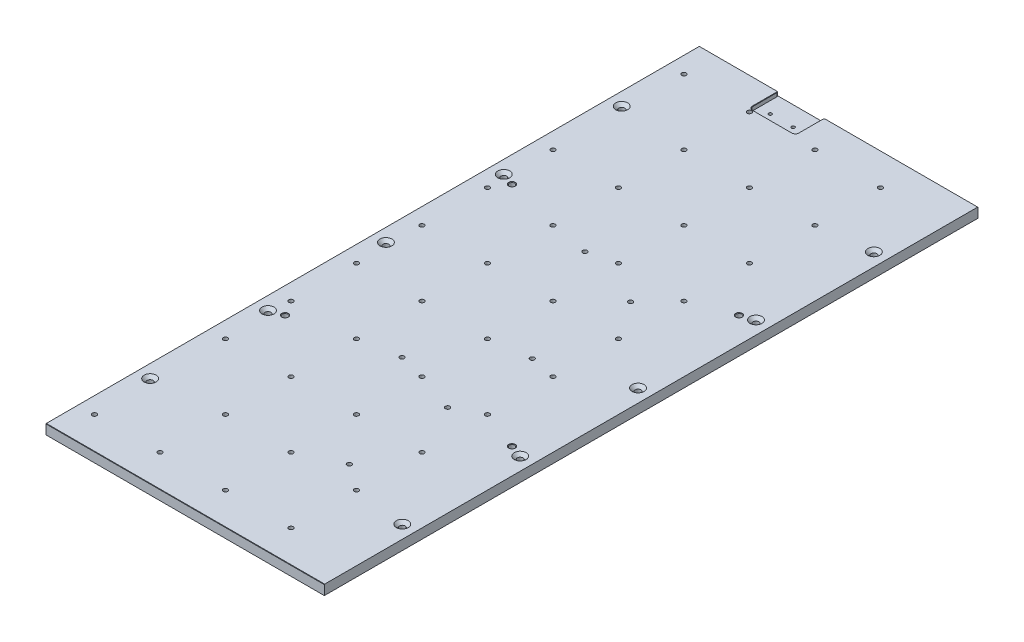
ISO-10303-21;
HEADER;
FILE_DESCRIPTION(('STEP AP214'),'2;1');
FILE_NAME('part.step','',(''),(''),'','','');
FILE_SCHEMA(('AUTOMOTIVE_DESIGN { 1 0 10303 214 1 1 1 1 }'));
ENDSEC;
DATA;
#1=APPLICATION_CONTEXT('core data for automotive mechanical design processes');
#2=APPLICATION_PROTOCOL_DEFINITION('international standard','automotive_design',2000,#1);
#3=PRODUCT_CONTEXT('',#1,'mechanical');
#4=PRODUCT('Part','Part','',(#3));
#5=PRODUCT_RELATED_PRODUCT_CATEGORY('part','',(#4));
#6=PRODUCT_DEFINITION_FORMATION('','',#4);
#7=PRODUCT_DEFINITION_CONTEXT('part definition',#1,'design');
#8=PRODUCT_DEFINITION('design','',#6,#7);
#9=PRODUCT_DEFINITION_SHAPE('','',#8);
#10=(LENGTH_UNIT() NAMED_UNIT(*) SI_UNIT(.MILLI.,.METRE.));
#11=(NAMED_UNIT(*) PLANE_ANGLE_UNIT() SI_UNIT($,.RADIAN.));
#12=(NAMED_UNIT(*) SI_UNIT($,.STERADIAN.) SOLID_ANGLE_UNIT());
#13=UNCERTAINTY_MEASURE_WITH_UNIT(LENGTH_MEASURE(1.E-05),#10,'distance_accuracy_value','');
#14=(GEOMETRIC_REPRESENTATION_CONTEXT(3) GLOBAL_UNCERTAINTY_ASSIGNED_CONTEXT((#13)) GLOBAL_UNIT_ASSIGNED_CONTEXT((#10,
#11,#12)) REPRESENTATION_CONTEXT('',''));
#15=CARTESIAN_POINT('',(0.,0.,0.));
#16=DIRECTION('',(0.,0.,1.));
#17=DIRECTION('',(1.,0.,0.));
#18=AXIS2_PLACEMENT_3D('',#15,#16,#17);
#19=CARTESIAN_POINT('',(-425.,0.,0.));
#20=DIRECTION('',(1.,0.,0.));
#21=DIRECTION('',(0.,0.,-1.));
#22=AXIS2_PLACEMENT_3D('',#19,#20,#21);
#23=PLANE('',#22);
#24=DIRECTION('',(0.,0.707106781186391,-0.707106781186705));
#25=VECTOR('',#24,1.);
#26=CARTESIAN_POINT('',(-425.,15.,498.5));
#27=LINE('',#26,#25);
#28=CARTESIAN_POINT('',(-425.,14.5000000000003,499.));
#29=VERTEX_POINT('',#28);
#30=CARTESIAN_POINT('',(-425.,15.,498.5));
#31=VERTEX_POINT('',#30);
#32=EDGE_CURVE('E181',#29,#31,#27,.T.);
#33=ORIENTED_EDGE('',*,*,#32,.T.);
#34=DIRECTION('',(0.,0.,-1.));
#35=VECTOR('',#34,1.);
#36=CARTESIAN_POINT('',(-425.,15.,0.));
#37=LINE('',#36,#35);
#38=CARTESIAN_POINT('',(-425.,15.,-498.5));
#39=VERTEX_POINT('',#38);
#40=EDGE_CURVE('E185',#31,#39,#37,.T.);
#41=ORIENTED_EDGE('',*,*,#40,.T.);
#42=DIRECTION('',(0.,-0.707106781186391,-0.707106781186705));
#43=VECTOR('',#42,1.);
#44=CARTESIAN_POINT('',(-425.,15.,-498.5));
#45=LINE('',#44,#43);
#46=CARTESIAN_POINT('',(-425.,14.5000000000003,-499.));
#47=VERTEX_POINT('',#46);
#48=EDGE_CURVE('E171',#39,#47,#45,.T.);
#49=ORIENTED_EDGE('',*,*,#48,.T.);
#50=DIRECTION('',(0.,1.,0.));
#51=VECTOR('',#50,1.);
#52=CARTESIAN_POINT('',(-425.,15.,-499.));
#53=LINE('',#52,#51);
#54=CARTESIAN_POINT('',(-425.,0.,-499.));
#55=VERTEX_POINT('',#54);
#56=EDGE_CURVE('E590',#55,#47,#53,.T.);
#57=ORIENTED_EDGE('',*,*,#56,.F.);
#58=DIRECTION('',(0.,0.,-1.));
#59=VECTOR('',#58,1.);
#60=CARTESIAN_POINT('',(-425.,0.,0.));
#61=LINE('',#60,#59);
#62=CARTESIAN_POINT('',(-425.,0.,499.));
#63=VERTEX_POINT('',#62);
#64=EDGE_CURVE('E582',#63,#55,#61,.T.);
#65=ORIENTED_EDGE('',*,*,#64,.F.);
#66=DIRECTION('',(0.,-1.,0.));
#67=VECTOR('',#66,1.);
#68=CARTESIAN_POINT('',(-425.,15.,499.));
#69=LINE('',#68,#67);
#70=EDGE_CURVE('E586',#29,#63,#69,.T.);
#71=ORIENTED_EDGE('',*,*,#70,.F.);
#72=EDGE_LOOP('',(#33,#41,#49,#57,#65,#71));
#73=FACE_BOUND('',#72,.T.);
#74=ADVANCED_FACE('F41',(#73),#23,.F.);
#75=CARTESIAN_POINT('',(0.,0.,0.));
#76=DIRECTION('',(1.,0.,0.));
#77=DIRECTION('',(0.,0.,-1.));
#78=AXIS2_PLACEMENT_3D('',#75,#76,#77);
#79=PLANE('',#78);
#80=DIRECTION('',(0.,0.707106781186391,-0.707106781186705));
#81=VECTOR('',#80,1.);
#82=CARTESIAN_POINT('',(0.,15.,498.5));
#83=LINE('',#82,#81);
#84=CARTESIAN_POINT('',(0.,14.5000000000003,499.));
#85=VERTEX_POINT('',#84);
#86=CARTESIAN_POINT('',(0.,15.,498.5));
#87=VERTEX_POINT('',#86);
#88=EDGE_CURVE('E580',#85,#87,#83,.T.);
#89=ORIENTED_EDGE('',*,*,#88,.F.);
#90=DIRECTION('',(0.,-1.,0.));
#91=VECTOR('',#90,1.);
#92=CARTESIAN_POINT('',(0.,15.,499.));
#93=LINE('',#92,#91);
#94=CARTESIAN_POINT('',(0.,0.,499.));
#95=VERTEX_POINT('',#94);
#96=EDGE_CURVE('E190',#85,#95,#93,.T.);
#97=ORIENTED_EDGE('',*,*,#96,.T.);
#98=DIRECTION('',(0.,0.,-1.));
#99=VECTOR('',#98,1.);
#100=CARTESIAN_POINT('',(0.,0.,0.));
#101=LINE('',#100,#99);
#102=CARTESIAN_POINT('',(0.,0.,-499.));
#103=VERTEX_POINT('',#102);
#104=EDGE_CURVE('E191',#95,#103,#101,.T.);
#105=ORIENTED_EDGE('',*,*,#104,.T.);
#106=DIRECTION('',(0.,1.,0.));
#107=VECTOR('',#106,1.);
#108=CARTESIAN_POINT('',(0.,15.,-499.));
#109=LINE('',#108,#107);
#110=CARTESIAN_POINT('',(0.,14.5000000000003,-499.));
#111=VERTEX_POINT('',#110);
#112=EDGE_CURVE('E587',#103,#111,#109,.T.);
#113=ORIENTED_EDGE('',*,*,#112,.T.);
#114=DIRECTION('',(0.,-0.707106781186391,-0.707106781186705));
#115=VECTOR('',#114,1.);
#116=CARTESIAN_POINT('',(0.,15.,-498.5));
#117=LINE('',#116,#115);
#118=CARTESIAN_POINT('',(0.,15.,-498.5));
#119=VERTEX_POINT('',#118);
#120=EDGE_CURVE('E577',#119,#111,#117,.T.);
#121=ORIENTED_EDGE('',*,*,#120,.F.);
#122=DIRECTION('',(0.,0.,-1.));
#123=VECTOR('',#122,1.);
#124=CARTESIAN_POINT('',(0.,15.,0.));
#125=LINE('',#124,#123);
#126=EDGE_CURVE('E583',#87,#119,#125,.T.);
#127=ORIENTED_EDGE('',*,*,#126,.F.);
#128=EDGE_LOOP('',(#89,#97,#105,#113,#121,#127));
#129=FACE_BOUND('',#128,.T.);
#130=ADVANCED_FACE('F750',(#129),#79,.T.);
#131=CARTESIAN_POINT('',(-305.1,9.,-499.));
#132=DIRECTION('',(-1.,0.,0.));
#133=DIRECTION('',(0.,0.,1.));
#134=AXIS2_PLACEMENT_3D('',#131,#132,#133);
#135=PLANE('',#134);
#136=DIRECTION('',(0.,1.,0.));
#137=VECTOR('',#136,1.);
#138=CARTESIAN_POINT('',(-305.1,9.,-497.));
#139=LINE('',#138,#137);
#140=CARTESIAN_POINT('',(-305.1,9.,-497.));
#141=VERTEX_POINT('',#140);
#142=CARTESIAN_POINT('',(-305.1,14.5000000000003,-497.));
#143=VERTEX_POINT('',#142);
#144=EDGE_CURVE('E209',#141,#143,#139,.T.);
#145=ORIENTED_EDGE('',*,*,#144,.T.);
#146=DIRECTION('',(0.,0.,1.));
#147=VECTOR('',#146,1.);
#148=CARTESIAN_POINT('',(-305.1,14.5000000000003,-460.));
#149=LINE('',#148,#147);
#150=CARTESIAN_POINT('',(-305.1,14.5000000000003,-460.));
#151=VERTEX_POINT('',#150);
#152=EDGE_CURVE('E662',#143,#151,#149,.T.);
#153=ORIENTED_EDGE('',*,*,#152,.T.);
#154=DIRECTION('',(0.,1.,0.));
#155=VECTOR('',#154,1.);
#156=CARTESIAN_POINT('',(-305.1,9.,-460.));
#157=LINE('',#156,#155);
#158=CARTESIAN_POINT('',(-305.1,9.,-460.));
#159=VERTEX_POINT('',#158);
#160=EDGE_CURVE('E300',#159,#151,#157,.T.);
#161=ORIENTED_EDGE('',*,*,#160,.F.);
#162=DIRECTION('',(0.,0.,1.));
#163=VECTOR('',#162,1.);
#164=CARTESIAN_POINT('',(-305.1,9.,-499.));
#165=LINE('',#164,#163);
#166=EDGE_CURVE('E58',#141,#159,#165,.T.);
#167=ORIENTED_EDGE('',*,*,#166,.F.);
#168=EDGE_LOOP('',(#145,#153,#161,#167));
#169=FACE_BOUND('',#168,.T.);
#170=ADVANCED_FACE('F693',(#169),#135,.F.);
#171=CARTESIAN_POINT('',(-300.1,9.,-460.));
#172=DIRECTION('',(0.,1.,0.));
#173=DIRECTION('',(0.,0.,1.));
#174=AXIS2_PLACEMENT_3D('',#171,#172,#173);
#175=CYLINDRICAL_SURFACE('',#174,5.00000000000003);
#176=ORIENTED_EDGE('',*,*,#160,.T.);
#177=CARTESIAN_POINT('',(-300.1,14.5000000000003,-460.));
#178=DIRECTION('',(0.,1.,0.));
#179=DIRECTION('',(0.,0.,1.));
#180=AXIS2_PLACEMENT_3D('',#177,#178,#179);
#181=CIRCLE('',#180,5.00000000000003);
#182=CARTESIAN_POINT('',(-300.1,14.5000000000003,-455.));
#183=VERTEX_POINT('',#182);
#184=EDGE_CURVE('E664',#151,#183,#181,.T.);
#185=ORIENTED_EDGE('',*,*,#184,.T.);
#186=DIRECTION('',(0.,1.,0.));
#187=VECTOR('',#186,1.);
#188=CARTESIAN_POINT('',(-300.1,9.,-455.));
#189=LINE('',#188,#187);
#190=CARTESIAN_POINT('',(-300.1,9.,-455.));
#191=VERTEX_POINT('',#190);
#192=EDGE_CURVE('E66',#191,#183,#189,.T.);
#193=ORIENTED_EDGE('',*,*,#192,.F.);
#194=CARTESIAN_POINT('',(-300.1,9.,-460.));
#195=DIRECTION('',(0.,1.,0.));
#196=DIRECTION('',(0.,0.,-1.));
#197=AXIS2_PLACEMENT_3D('',#194,#195,#196);
#198=CIRCLE('',#197,5.00000000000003);
#199=EDGE_CURVE('E321',#159,#191,#198,.T.);
#200=ORIENTED_EDGE('',*,*,#199,.F.);
#201=EDGE_LOOP('',(#176,#185,#193,#200));
#202=FACE_BOUND('',#201,.T.);
#203=ADVANCED_FACE('F695',(#202),#175,.F.);
#204=CARTESIAN_POINT('',(-300.1,9.,-455.));
#205=DIRECTION('',(0.,0.,1.));
#206=DIRECTION('',(1.,0.,0.));
#207=AXIS2_PLACEMENT_3D('',#204,#205,#206);
#208=PLANE('',#207);
#209=ORIENTED_EDGE('',*,*,#192,.T.);
#210=DIRECTION('',(1.,0.,0.));
#211=VECTOR('',#210,1.);
#212=CARTESIAN_POINT('',(-239.9,14.5000000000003,-455.));
#213=LINE('',#212,#211);
#214=CARTESIAN_POINT('',(-239.9,14.5000000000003,-455.));
#215=VERTEX_POINT('',#214);
#216=EDGE_CURVE('E666',#183,#215,#213,.T.);
#217=ORIENTED_EDGE('',*,*,#216,.T.);
#218=DIRECTION('',(0.,1.,0.));
#219=VECTOR('',#218,1.);
#220=CARTESIAN_POINT('',(-239.9,9.,-455.));
#221=LINE('',#220,#219);
#222=CARTESIAN_POINT('',(-239.9,9.,-455.));
#223=VERTEX_POINT('',#222);
#224=EDGE_CURVE('E305',#223,#215,#221,.T.);
#225=ORIENTED_EDGE('',*,*,#224,.F.);
#226=DIRECTION('',(1.,0.,0.));
#227=VECTOR('',#226,1.);
#228=CARTESIAN_POINT('',(-300.1,9.,-455.));
#229=LINE('',#228,#227);
#230=EDGE_CURVE('E318',#191,#223,#229,.T.);
#231=ORIENTED_EDGE('',*,*,#230,.F.);
#232=EDGE_LOOP('',(#209,#217,#225,#231));
#233=FACE_BOUND('',#232,.T.);
#234=ADVANCED_FACE('F699',(#233),#208,.F.);
#235=CARTESIAN_POINT('',(-239.9,9.,-460.));
#236=DIRECTION('',(0.,1.,0.));
#237=DIRECTION('',(0.,0.,1.));
#238=AXIS2_PLACEMENT_3D('',#235,#236,#237);
#239=CYLINDRICAL_SURFACE('',#238,5.00000000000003);
#240=ORIENTED_EDGE('',*,*,#224,.T.);
#241=CARTESIAN_POINT('',(-239.9,14.5000000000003,-460.));
#242=DIRECTION('',(0.,1.,0.));
#243=DIRECTION('',(0.,0.,1.));
#244=AXIS2_PLACEMENT_3D('',#241,#242,#243);
#245=CIRCLE('',#244,5.00000000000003);
#246=CARTESIAN_POINT('',(-234.9,14.5000000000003,-460.));
#247=VERTEX_POINT('',#246);
#248=EDGE_CURVE('E668',#215,#247,#245,.T.);
#249=ORIENTED_EDGE('',*,*,#248,.T.);
#250=DIRECTION('',(0.,1.,0.));
#251=VECTOR('',#250,1.);
#252=CARTESIAN_POINT('',(-234.9,9.,-460.));
#253=LINE('',#252,#251);
#254=CARTESIAN_POINT('',(-234.9,9.,-460.));
#255=VERTEX_POINT('',#254);
#256=EDGE_CURVE('E299',#255,#247,#253,.T.);
#257=ORIENTED_EDGE('',*,*,#256,.F.);
#258=CARTESIAN_POINT('',(-239.9,9.,-460.));
#259=DIRECTION('',(0.,1.,0.));
#260=DIRECTION('',(0.,0.,-1.));
#261=AXIS2_PLACEMENT_3D('',#258,#259,#260);
#262=CIRCLE('',#261,5.00000000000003);
#263=EDGE_CURVE('E315',#223,#255,#262,.T.);
#264=ORIENTED_EDGE('',*,*,#263,.F.);
#265=EDGE_LOOP('',(#240,#249,#257,#264));
#266=FACE_BOUND('',#265,.T.);
#267=ADVANCED_FACE('F704',(#266),#239,.F.);
#268=CARTESIAN_POINT('',(-234.9,9.,-499.));
#269=DIRECTION('',(1.,0.,0.));
#270=DIRECTION('',(0.,0.,-1.));
#271=AXIS2_PLACEMENT_3D('',#268,#269,#270);
#272=PLANE('',#271);
#273=ORIENTED_EDGE('',*,*,#256,.T.);
#274=DIRECTION('',(0.,0.,-1.));
#275=VECTOR('',#274,1.);
#276=CARTESIAN_POINT('',(-234.9,14.5000000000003,-497.));
#277=LINE('',#276,#275);
#278=CARTESIAN_POINT('',(-234.9,14.5000000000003,-497.));
#279=VERTEX_POINT('',#278);
#280=EDGE_CURVE('E670',#247,#279,#277,.T.);
#281=ORIENTED_EDGE('',*,*,#280,.T.);
#282=DIRECTION('',(0.,1.,0.));
#283=VECTOR('',#282,1.);
#284=CARTESIAN_POINT('',(-234.9,9.,-497.));
#285=LINE('',#284,#283);
#286=CARTESIAN_POINT('',(-234.9,9.,-497.));
#287=VERTEX_POINT('',#286);
#288=EDGE_CURVE('E212',#279,#287,#285,.F.);
#289=ORIENTED_EDGE('',*,*,#288,.T.);
#290=DIRECTION('',(0.,0.,-1.));
#291=VECTOR('',#290,1.);
#292=CARTESIAN_POINT('',(-234.9,9.,-499.));
#293=LINE('',#292,#291);
#294=EDGE_CURVE('E312',#255,#287,#293,.T.);
#295=ORIENTED_EDGE('',*,*,#294,.F.);
#296=EDGE_LOOP('',(#273,#281,#289,#295));
#297=FACE_BOUND('',#296,.T.);
#298=ADVANCED_FACE('F709',(#297),#272,.F.);
#299=CARTESIAN_POINT('',(-232.9,15.,-497.));
#300=DIRECTION('',(0.,1.,0.));
#301=DIRECTION('',(0.,0.,1.));
#302=AXIS2_PLACEMENT_3D('',#299,#300,#301);
#303=CYLINDRICAL_SURFACE('',#302,2.);
#304=ORIENTED_EDGE('',*,*,#288,.F.);
#305=CARTESIAN_POINT('',(-232.9,14.5000000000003,-497.));
#306=DIRECTION('',(0.,1.,0.));
#307=DIRECTION('',(0.,0.,1.));
#308=AXIS2_PLACEMENT_3D('',#305,#306,#307);
#309=CIRCLE('',#308,2.);
#310=CARTESIAN_POINT('',(-232.9,14.5000000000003,-499.));
#311=VERTEX_POINT('',#310);
#312=EDGE_CURVE('E598',#279,#311,#309,.F.);
#313=ORIENTED_EDGE('',*,*,#312,.T.);
#314=DIRECTION('',(0.,1.,0.));
#315=VECTOR('',#314,1.);
#316=CARTESIAN_POINT('',(-232.9,15.,-499.));
#317=LINE('',#316,#315);
#318=CARTESIAN_POINT('',(-232.9,9.,-499.));
#319=VERTEX_POINT('',#318);
#320=EDGE_CURVE('E214',#319,#311,#317,.T.);
#321=ORIENTED_EDGE('',*,*,#320,.F.);
#322=CARTESIAN_POINT('',(-232.9,9.,-497.));
#323=DIRECTION('',(0.,-1.,0.));
#324=DIRECTION('',(0.,0.,-1.));
#325=AXIS2_PLACEMENT_3D('',#322,#323,#324);
#326=CIRCLE('',#325,2.);
#327=EDGE_CURVE('E206',#287,#319,#326,.T.);
#328=ORIENTED_EDGE('',*,*,#327,.F.);
#329=EDGE_LOOP('',(#304,#313,#321,#328));
#330=FACE_BOUND('',#329,.T.);
#331=ADVANCED_FACE('F714',(#330),#303,.T.);
#332=CARTESIAN_POINT('',(-300.1,9.,-460.));
#333=DIRECTION('',(0.,-1.,0.));
#334=DIRECTION('',(0.,0.,-1.));
#335=AXIS2_PLACEMENT_3D('',#332,#333,#334);
#336=PLANE('',#335);
#337=CARTESIAN_POINT('',(-287.5,9.,-469.2));
#338=DIRECTION('',(0.,1.,0.));
#339=DIRECTION('',(0.,0.,1.));
#340=AXIS2_PLACEMENT_3D('',#337,#338,#339);
#341=CIRCLE('',#340,2.5);
#342=CARTESIAN_POINT('',(-287.5,9.,-466.7));
#343=VERTEX_POINT('',#342);
#344=EDGE_CURVE('E333',#343,#343,#341,.T.);
#345=ORIENTED_EDGE('',*,*,#344,.F.);
#346=EDGE_LOOP('',(#345));
#347=FACE_BOUND('',#346,.T.);
#348=CARTESIAN_POINT('',(-252.5,9.,-469.2));
#349=DIRECTION('',(0.,1.,0.));
#350=DIRECTION('',(0.,0.,1.));
#351=AXIS2_PLACEMENT_3D('',#348,#349,#350);
#352=CIRCLE('',#351,2.5);
#353=CARTESIAN_POINT('',(-252.5,9.,-466.7));
#354=VERTEX_POINT('',#353);
#355=EDGE_CURVE('E327',#354,#354,#352,.T.);
#356=ORIENTED_EDGE('',*,*,#355,.F.);
#357=EDGE_LOOP('',(#356));
#358=FACE_BOUND('',#357,.T.);
#359=DIRECTION('',(-1.,0.,0.));
#360=VECTOR('',#359,1.);
#361=CARTESIAN_POINT('',(-305.1,9.,-499.));
#362=LINE('',#361,#360);
#363=CARTESIAN_POINT('',(-307.1,9.,-499.));
#364=VERTEX_POINT('',#363);
#365=EDGE_CURVE('E303',#319,#364,#362,.T.);
#366=ORIENTED_EDGE('',*,*,#365,.T.);
#367=CARTESIAN_POINT('',(-307.1,9.,-497.));
#368=DIRECTION('',(0.,-1.,0.));
#369=DIRECTION('',(0.,0.,-1.));
#370=AXIS2_PLACEMENT_3D('',#367,#368,#369);
#371=CIRCLE('',#370,2.);
#372=EDGE_CURVE('E199',#364,#141,#371,.T.);
#373=ORIENTED_EDGE('',*,*,#372,.T.);
#374=ORIENTED_EDGE('',*,*,#166,.T.);
#375=ORIENTED_EDGE('',*,*,#199,.T.);
#376=ORIENTED_EDGE('',*,*,#230,.T.);
#377=ORIENTED_EDGE('',*,*,#263,.T.);
#378=ORIENTED_EDGE('',*,*,#294,.T.);
#379=ORIENTED_EDGE('',*,*,#327,.T.);
#380=EDGE_LOOP('',(#366,#373,#374,#375,#376,#377,#378,#379));
#381=FACE_BOUND('',#380,.T.);
#382=ADVANCED_FACE('F696',(#347,#358,#381),#336,.F.);
#383=CARTESIAN_POINT('',(-307.1,9.,-497.));
#384=DIRECTION('',(0.,1.,0.));
#385=DIRECTION('',(0.,0.,1.));
#386=AXIS2_PLACEMENT_3D('',#383,#384,#385);
#387=CYLINDRICAL_SURFACE('',#386,2.);
#388=DIRECTION('',(0.,1.,0.));
#389=VECTOR('',#388,1.);
#390=CARTESIAN_POINT('',(-307.1,15.,-499.));
#391=LINE('',#390,#389);
#392=CARTESIAN_POINT('',(-307.1,14.5000000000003,-499.));
#393=VERTEX_POINT('',#392);
#394=EDGE_CURVE('E217',#393,#364,#391,.F.);
#395=ORIENTED_EDGE('',*,*,#394,.F.);
#396=CARTESIAN_POINT('',(-307.1,14.5000000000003,-497.));
#397=DIRECTION('',(0.,1.,0.));
#398=DIRECTION('',(0.,0.,1.));
#399=AXIS2_PLACEMENT_3D('',#396,#397,#398);
#400=CIRCLE('',#399,2.);
#401=EDGE_CURVE('E607',#393,#143,#400,.F.);
#402=ORIENTED_EDGE('',*,*,#401,.T.);
#403=ORIENTED_EDGE('',*,*,#144,.F.);
#404=ORIENTED_EDGE('',*,*,#372,.F.);
#405=EDGE_LOOP('',(#395,#402,#403,#404));
#406=FACE_BOUND('',#405,.T.);
#407=ADVANCED_FACE('F776',(#406),#387,.T.);
#408=CARTESIAN_POINT('',(-20.,15.,-360.));
#409=DIRECTION('',(0.,1.,0.));
#410=DIRECTION('',(0.,0.,1.));
#411=AXIS2_PLACEMENT_3D('',#408,#409,#410);
#412=CONICAL_SURFACE('',#411,9.125,0.785398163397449);
#413=CARTESIAN_POINT('',(-20.,10.375,-360.));
#414=DIRECTION('',(0.,1.,0.));
#415=DIRECTION('',(0.,0.,1.));
#416=AXIS2_PLACEMENT_3D('',#413,#414,#415);
#417=CIRCLE('',#416,4.5);
#418=CARTESIAN_POINT('',(-20.,10.375,-355.5));
#419=VERTEX_POINT('',#418);
#420=EDGE_CURVE('E293',#419,#419,#417,.T.);
#421=ORIENTED_EDGE('',*,*,#420,.F.);
#422=EDGE_LOOP('',(#421));
#423=FACE_BOUND('',#422,.T.);
#424=CARTESIAN_POINT('',(-20.,15.,-360.));
#425=DIRECTION('',(0.,1.,0.));
#426=DIRECTION('',(0.,0.,1.));
#427=AXIS2_PLACEMENT_3D('',#424,#425,#426);
#428=CIRCLE('',#427,9.125);
#429=CARTESIAN_POINT('',(-20.,15.,-350.875));
#430=VERTEX_POINT('',#429);
#431=EDGE_CURVE('E296',#430,#430,#428,.T.);
#432=ORIENTED_EDGE('',*,*,#431,.T.);
#433=EDGE_LOOP('',(#432));
#434=FACE_BOUND('',#433,.T.);
#435=ADVANCED_FACE('F779',(#423,#434),#412,.F.);
#436=CARTESIAN_POINT('',(-20.,15.,360.));
#437=DIRECTION('',(0.,1.,0.));
#438=DIRECTION('',(0.,0.,1.));
#439=AXIS2_PLACEMENT_3D('',#436,#437,#438);
#440=CONICAL_SURFACE('',#439,9.125,0.785398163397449);
#441=CARTESIAN_POINT('',(-20.,10.375,360.));
#442=DIRECTION('',(0.,1.,0.));
#443=DIRECTION('',(0.,0.,1.));
#444=AXIS2_PLACEMENT_3D('',#441,#442,#443);
#445=CIRCLE('',#444,4.5);
#446=CARTESIAN_POINT('',(-20.,10.375,364.5));
#447=VERTEX_POINT('',#446);
#448=EDGE_CURVE('E284',#447,#447,#445,.T.);
#449=ORIENTED_EDGE('',*,*,#448,.F.);
#450=EDGE_LOOP('',(#449));
#451=FACE_BOUND('',#450,.T.);
#452=CARTESIAN_POINT('',(-20.,15.,360.));
#453=DIRECTION('',(0.,1.,0.));
#454=DIRECTION('',(0.,0.,1.));
#455=AXIS2_PLACEMENT_3D('',#452,#453,#454);
#456=CIRCLE('',#455,9.125);
#457=CARTESIAN_POINT('',(-20.,15.,369.125));
#458=VERTEX_POINT('',#457);
#459=EDGE_CURVE('E287',#458,#458,#456,.T.);
#460=ORIENTED_EDGE('',*,*,#459,.T.);
#461=EDGE_LOOP('',(#460));
#462=FACE_BOUND('',#461,.T.);
#463=ADVANCED_FACE('F830',(#451,#462),#440,.F.);
#464=CARTESIAN_POINT('',(-20.,15.,0.));
#465=DIRECTION('',(0.,1.,0.));
#466=DIRECTION('',(0.,0.,1.));
#467=AXIS2_PLACEMENT_3D('',#464,#465,#466);
#468=CONICAL_SURFACE('',#467,9.125,0.785398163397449);
#469=CARTESIAN_POINT('',(-20.,10.375,0.));
#470=DIRECTION('',(0.,1.,0.));
#471=DIRECTION('',(0.,0.,1.));
#472=AXIS2_PLACEMENT_3D('',#469,#470,#471);
#473=CIRCLE('',#472,4.5);
#474=CARTESIAN_POINT('',(-20.,10.375,4.5));
#475=VERTEX_POINT('',#474);
#476=EDGE_CURVE('E275',#475,#475,#473,.T.);
#477=ORIENTED_EDGE('',*,*,#476,.F.);
#478=EDGE_LOOP('',(#477));
#479=FACE_BOUND('',#478,.T.);
#480=CARTESIAN_POINT('',(-20.,15.,0.));
#481=DIRECTION('',(0.,1.,0.));
#482=DIRECTION('',(0.,0.,1.));
#483=AXIS2_PLACEMENT_3D('',#480,#481,#482);
#484=CIRCLE('',#483,9.125);
#485=CARTESIAN_POINT('',(-20.,15.,9.125));
#486=VERTEX_POINT('',#485);
#487=EDGE_CURVE('E278',#486,#486,#484,.T.);
#488=ORIENTED_EDGE('',*,*,#487,.T.);
#489=EDGE_LOOP('',(#488));
#490=FACE_BOUND('',#489,.T.);
#491=ADVANCED_FACE('F822',(#479,#490),#468,.F.);
#492=CARTESIAN_POINT('',(-405.,15.,-360.));
#493=DIRECTION('',(0.,1.,0.));
#494=DIRECTION('',(0.,0.,1.));
#495=AXIS2_PLACEMENT_3D('',#492,#493,#494);
#496=CONICAL_SURFACE('',#495,9.12499999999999,0.785398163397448);
#497=CARTESIAN_POINT('',(-405.,10.375,-360.));
#498=DIRECTION('',(0.,1.,0.));
#499=DIRECTION('',(0.,0.,1.));
#500=AXIS2_PLACEMENT_3D('',#497,#498,#499);
#501=CIRCLE('',#500,4.5);
#502=CARTESIAN_POINT('',(-405.,10.375,-355.5));
#503=VERTEX_POINT('',#502);
#504=EDGE_CURVE('E266',#503,#503,#501,.T.);
#505=ORIENTED_EDGE('',*,*,#504,.F.);
#506=EDGE_LOOP('',(#505));
#507=FACE_BOUND('',#506,.T.);
#508=CARTESIAN_POINT('',(-405.,15.,-360.));
#509=DIRECTION('',(0.,1.,0.));
#510=DIRECTION('',(0.,0.,1.));
#511=AXIS2_PLACEMENT_3D('',#508,#509,#510);
#512=CIRCLE('',#511,9.12499999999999);
#513=CARTESIAN_POINT('',(-405.,15.,-350.875));
#514=VERTEX_POINT('',#513);
#515=EDGE_CURVE('E269',#514,#514,#512,.T.);
#516=ORIENTED_EDGE('',*,*,#515,.T.);
#517=EDGE_LOOP('',(#516));
#518=FACE_BOUND('',#517,.T.);
#519=ADVANCED_FACE('F814',(#507,#518),#496,.F.);
#520=CARTESIAN_POINT('',(-405.,15.,360.));
#521=DIRECTION('',(0.,1.,0.));
#522=DIRECTION('',(0.,0.,1.));
#523=AXIS2_PLACEMENT_3D('',#520,#521,#522);
#524=CONICAL_SURFACE('',#523,9.12499999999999,0.785398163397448);
#525=CARTESIAN_POINT('',(-405.,10.375,360.));
#526=DIRECTION('',(0.,1.,0.));
#527=DIRECTION('',(0.,0.,1.));
#528=AXIS2_PLACEMENT_3D('',#525,#526,#527);
#529=CIRCLE('',#528,4.5);
#530=CARTESIAN_POINT('',(-405.,10.375,364.5));
#531=VERTEX_POINT('',#530);
#532=EDGE_CURVE('E257',#531,#531,#529,.T.);
#533=ORIENTED_EDGE('',*,*,#532,.F.);
#534=EDGE_LOOP('',(#533));
#535=FACE_BOUND('',#534,.T.);
#536=CARTESIAN_POINT('',(-405.,15.,360.));
#537=DIRECTION('',(0.,1.,0.));
#538=DIRECTION('',(0.,0.,1.));
#539=AXIS2_PLACEMENT_3D('',#536,#537,#538);
#540=CIRCLE('',#539,9.12499999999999);
#541=CARTESIAN_POINT('',(-405.,15.,369.125));
#542=VERTEX_POINT('',#541);
#543=EDGE_CURVE('E260',#542,#542,#540,.T.);
#544=ORIENTED_EDGE('',*,*,#543,.T.);
#545=EDGE_LOOP('',(#544));
#546=FACE_BOUND('',#545,.T.);
#547=ADVANCED_FACE('F806',(#535,#546),#524,.F.);
#548=CARTESIAN_POINT('',(-405.,15.,0.));
#549=DIRECTION('',(0.,1.,0.));
#550=DIRECTION('',(0.,0.,1.));
#551=AXIS2_PLACEMENT_3D('',#548,#549,#550);
#552=CONICAL_SURFACE('',#551,9.12499999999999,0.785398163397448);
#553=CARTESIAN_POINT('',(-405.,10.375,0.));
#554=DIRECTION('',(0.,1.,0.));
#555=DIRECTION('',(0.,0.,1.));
#556=AXIS2_PLACEMENT_3D('',#553,#554,#555);
#557=CIRCLE('',#556,4.5);
#558=CARTESIAN_POINT('',(-405.,10.375,4.50000000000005));
#559=VERTEX_POINT('',#558);
#560=EDGE_CURVE('E248',#559,#559,#557,.T.);
#561=ORIENTED_EDGE('',*,*,#560,.F.);
#562=EDGE_LOOP('',(#561));
#563=FACE_BOUND('',#562,.T.);
#564=CARTESIAN_POINT('',(-405.,15.,0.));
#565=DIRECTION('',(0.,1.,0.));
#566=DIRECTION('',(0.,0.,1.));
#567=AXIS2_PLACEMENT_3D('',#564,#565,#566);
#568=CIRCLE('',#567,9.12499999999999);
#569=CARTESIAN_POINT('',(-405.,15.,9.12500000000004));
#570=VERTEX_POINT('',#569);
#571=EDGE_CURVE('E251',#570,#570,#568,.T.);
#572=ORIENTED_EDGE('',*,*,#571,.T.);
#573=EDGE_LOOP('',(#572));
#574=FACE_BOUND('',#573,.T.);
#575=ADVANCED_FACE('F747',(#563,#574),#552,.F.);
#576=CARTESIAN_POINT('',(-305.1,14.5000000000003,-499.));
#577=DIRECTION('',(0.707106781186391,0.707106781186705,0.));
#578=DIRECTION('',(0.,0.,-1.));
#579=AXIS2_PLACEMENT_3D('',#576,#577,#578);
#580=PLANE('',#579);
#581=DIRECTION('',(-0.707106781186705,0.707106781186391,0.));
#582=VECTOR('',#581,1.);
#583=CARTESIAN_POINT('',(-305.1,14.5000000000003,-497.));
#584=LINE('',#583,#582);
#585=CARTESIAN_POINT('',(-305.6,15.,-497.));
#586=VERTEX_POINT('',#585);
#587=EDGE_CURVE('E644',#143,#586,#584,.T.);
#588=ORIENTED_EDGE('',*,*,#587,.T.);
#589=DIRECTION('',(0.,0.,-1.));
#590=VECTOR('',#589,1.);
#591=CARTESIAN_POINT('',(-305.6,15.,-497.));
#592=LINE('',#591,#590);
#593=CARTESIAN_POINT('',(-305.6,15.,-460.));
#594=VERTEX_POINT('',#593);
#595=EDGE_CURVE('E201',#594,#586,#592,.T.);
#596=ORIENTED_EDGE('',*,*,#595,.F.);
#597=DIRECTION('',(-0.707106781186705,0.707106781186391,0.));
#598=VECTOR('',#597,1.);
#599=CARTESIAN_POINT('',(-305.1,14.5000000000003,-460.));
#600=LINE('',#599,#598);
#601=EDGE_CURVE('E647',#151,#594,#600,.T.);
#602=ORIENTED_EDGE('',*,*,#601,.F.);
#603=ORIENTED_EDGE('',*,*,#152,.F.);
#604=EDGE_LOOP('',(#588,#596,#602,#603));
#605=FACE_BOUND('',#604,.T.);
#606=ADVANCED_FACE('F690',(#605),#580,.T.);
#607=CARTESIAN_POINT('',(-300.1,14.5000000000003,-460.));
#608=DIRECTION('',(0.,1.,0.));
#609=DIRECTION('',(0.,0.,1.));
#610=AXIS2_PLACEMENT_3D('',#607,#608,#609);
#611=CONICAL_SURFACE('',#610,5.00000000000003,0.785398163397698);
#612=ORIENTED_EDGE('',*,*,#601,.T.);
#613=CARTESIAN_POINT('',(-300.1,15.,-460.));
#614=DIRECTION('',(0.,1.,0.));
#615=DIRECTION('',(0.,0.,1.));
#616=AXIS2_PLACEMENT_3D('',#613,#614,#615);
#617=CIRCLE('',#616,5.50000000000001);
#618=CARTESIAN_POINT('',(-300.1,15.,-454.5));
#619=VERTEX_POINT('',#618);
#620=EDGE_CURVE('E680',#619,#594,#617,.F.);
#621=ORIENTED_EDGE('',*,*,#620,.F.);
#622=DIRECTION('',(0.,0.707106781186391,0.707106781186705));
#623=VECTOR('',#622,1.);
#624=CARTESIAN_POINT('',(-300.1,14.5000000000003,-455.));
#625=LINE('',#624,#623);
#626=EDGE_CURVE('E650',#183,#619,#625,.T.);
#627=ORIENTED_EDGE('',*,*,#626,.F.);
#628=ORIENTED_EDGE('',*,*,#184,.F.);
#629=EDGE_LOOP('',(#612,#621,#627,#628));
#630=FACE_BOUND('',#629,.T.);
#631=ADVANCED_FACE('F739',(#630),#611,.F.);
#632=CARTESIAN_POINT('',(-300.1,14.5000000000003,-455.));
#633=DIRECTION('',(0.,0.707106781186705,-0.707106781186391));
#634=DIRECTION('',(-1.,0.,0.));
#635=AXIS2_PLACEMENT_3D('',#632,#633,#634);
#636=PLANE('',#635);
#637=ORIENTED_EDGE('',*,*,#626,.T.);
#638=DIRECTION('',(-1.,0.,0.));
#639=VECTOR('',#638,1.);
#640=CARTESIAN_POINT('',(-300.1,15.,-454.5));
#641=LINE('',#640,#639);
#642=CARTESIAN_POINT('',(-239.9,15.,-454.5));
#643=VERTEX_POINT('',#642);
#644=EDGE_CURVE('E678',#643,#619,#641,.T.);
#645=ORIENTED_EDGE('',*,*,#644,.F.);
#646=DIRECTION('',(0.,0.707106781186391,0.707106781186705));
#647=VECTOR('',#646,1.);
#648=CARTESIAN_POINT('',(-239.9,14.5000000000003,-455.));
#649=LINE('',#648,#647);
#650=EDGE_CURVE('E653',#215,#643,#649,.T.);
#651=ORIENTED_EDGE('',*,*,#650,.F.);
#652=ORIENTED_EDGE('',*,*,#216,.F.);
#653=EDGE_LOOP('',(#637,#645,#651,#652));
#654=FACE_BOUND('',#653,.T.);
#655=ADVANCED_FACE('F737',(#654),#636,.T.);
#656=CARTESIAN_POINT('',(-239.9,14.5000000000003,-460.));
#657=DIRECTION('',(0.,1.,0.));
#658=DIRECTION('',(0.,0.,1.));
#659=AXIS2_PLACEMENT_3D('',#656,#657,#658);
#660=CONICAL_SURFACE('',#659,5.00000000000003,0.78539816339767);
#661=ORIENTED_EDGE('',*,*,#650,.T.);
#662=CARTESIAN_POINT('',(-239.9,15.,-460.));
#663=DIRECTION('',(0.,1.,0.));
#664=DIRECTION('',(0.,0.,1.));
#665=AXIS2_PLACEMENT_3D('',#662,#663,#664);
#666=CIRCLE('',#665,5.49999999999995);
#667=CARTESIAN_POINT('',(-234.4,15.,-460.));
#668=VERTEX_POINT('',#667);
#669=EDGE_CURVE('E676',#668,#643,#666,.F.);
#670=ORIENTED_EDGE('',*,*,#669,.F.);
#671=DIRECTION('',(0.707106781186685,0.70710678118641,0.));
#672=VECTOR('',#671,1.);
#673=CARTESIAN_POINT('',(-234.9,14.5000000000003,-460.));
#674=LINE('',#673,#672);
#675=EDGE_CURVE('E656',#247,#668,#674,.T.);
#676=ORIENTED_EDGE('',*,*,#675,.F.);
#677=ORIENTED_EDGE('',*,*,#248,.F.);
#678=EDGE_LOOP('',(#661,#670,#676,#677));
#679=FACE_BOUND('',#678,.T.);
#680=ADVANCED_FACE('F734',(#679),#660,.F.);
#681=CARTESIAN_POINT('',(-234.9,14.5000000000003,-499.));
#682=DIRECTION('',(-0.707106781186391,0.707106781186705,0.));
#683=DIRECTION('',(0.,0.,1.));
#684=AXIS2_PLACEMENT_3D('',#681,#682,#683);
#685=PLANE('',#684);
#686=ORIENTED_EDGE('',*,*,#675,.T.);
#687=DIRECTION('',(0.,0.,1.));
#688=VECTOR('',#687,1.);
#689=CARTESIAN_POINT('',(-234.4,15.,-460.));
#690=LINE('',#689,#688);
#691=CARTESIAN_POINT('',(-234.4,15.,-497.));
#692=VERTEX_POINT('',#691);
#693=EDGE_CURVE('E674',#692,#668,#690,.T.);
#694=ORIENTED_EDGE('',*,*,#693,.F.);
#695=DIRECTION('',(0.707106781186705,0.707106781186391,0.));
#696=VECTOR('',#695,1.);
#697=CARTESIAN_POINT('',(-234.9,14.5000000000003,-497.));
#698=LINE('',#697,#696);
#699=EDGE_CURVE('E50',#279,#692,#698,.T.);
#700=ORIENTED_EDGE('',*,*,#699,.F.);
#701=ORIENTED_EDGE('',*,*,#280,.F.);
#702=EDGE_LOOP('',(#686,#694,#700,#701));
#703=FACE_BOUND('',#702,.T.);
#704=ADVANCED_FACE('F731',(#703),#685,.T.);
#705=CARTESIAN_POINT('',(-307.1,15.,-497.));
#706=DIRECTION('',(0.,-1.,0.));
#707=DIRECTION('',(0.,0.,-1.));
#708=AXIS2_PLACEMENT_3D('',#705,#706,#707);
#709=CONICAL_SURFACE('',#708,1.50000000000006,0.785398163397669);
#710=DIRECTION('',(0.,0.707106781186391,0.707106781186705));
#711=VECTOR('',#710,1.);
#712=CARTESIAN_POINT('',(-307.1,14.5000000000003,-499.));
#713=LINE('',#712,#711);
#714=CARTESIAN_POINT('',(-307.1,15.,-498.5));
#715=VERTEX_POINT('',#714);
#716=EDGE_CURVE('E576',#393,#715,#713,.T.);
#717=ORIENTED_EDGE('',*,*,#716,.T.);
#718=CARTESIAN_POINT('',(-307.1,15.,-497.));
#719=DIRECTION('',(0.,1.,0.));
#720=DIRECTION('',(0.,0.,1.));
#721=AXIS2_PLACEMENT_3D('',#718,#719,#720);
#722=CIRCLE('',#721,1.50000000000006);
#723=EDGE_CURVE('E196',#586,#715,#722,.T.);
#724=ORIENTED_EDGE('',*,*,#723,.F.);
#725=ORIENTED_EDGE('',*,*,#587,.F.);
#726=ORIENTED_EDGE('',*,*,#401,.F.);
#727=EDGE_LOOP('',(#717,#724,#725,#726));
#728=FACE_BOUND('',#727,.T.);
#729=ADVANCED_FACE('F687',(#728),#709,.T.);
#730=CARTESIAN_POINT('',(-232.9,15.,-497.));
#731=DIRECTION('',(0.,-1.,0.));
#732=DIRECTION('',(0.,0.,-1.));
#733=AXIS2_PLACEMENT_3D('',#730,#731,#732);
#734=CONICAL_SURFACE('',#733,1.50000000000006,0.785398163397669);
#735=ORIENTED_EDGE('',*,*,#699,.T.);
#736=CARTESIAN_POINT('',(-232.9,15.,-497.));
#737=DIRECTION('',(0.,1.,0.));
#738=DIRECTION('',(0.,0.,1.));
#739=AXIS2_PLACEMENT_3D('',#736,#737,#738);
#740=CIRCLE('',#739,1.50000000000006);
#741=CARTESIAN_POINT('',(-232.9,15.,-498.5));
#742=VERTEX_POINT('',#741);
#743=EDGE_CURVE('E601',#742,#692,#740,.T.);
#744=ORIENTED_EDGE('',*,*,#743,.F.);
#745=DIRECTION('',(0.,0.707106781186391,0.707106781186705));
#746=VECTOR('',#745,1.);
#747=CARTESIAN_POINT('',(-232.9,14.5000000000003,-499.));
#748=LINE('',#747,#746);
#749=EDGE_CURVE('E12',#311,#742,#748,.T.);
#750=ORIENTED_EDGE('',*,*,#749,.F.);
#751=ORIENTED_EDGE('',*,*,#312,.F.);
#752=EDGE_LOOP('',(#735,#744,#750,#751));
#753=FACE_BOUND('',#752,.T.);
#754=ADVANCED_FACE('F727',(#753),#734,.T.);
#755=CARTESIAN_POINT('',(-688.,15.,-499.));
#756=DIRECTION('',(0.,0.,1.));
#757=DIRECTION('',(1.,0.,0.));
#758=AXIS2_PLACEMENT_3D('',#755,#756,#757);
#759=PLANE('',#758);
#760=DIRECTION('',(-1.,0.,0.));
#761=VECTOR('',#760,1.);
#762=CARTESIAN_POINT('',(-688.,0.,-499.));
#763=LINE('',#762,#761);
#764=EDGE_CURVE('E224',#103,#55,#763,.T.);
#765=ORIENTED_EDGE('',*,*,#764,.T.);
#766=ORIENTED_EDGE('',*,*,#56,.T.);
#767=DIRECTION('',(1.,0.,0.));
#768=VECTOR('',#767,1.);
#769=CARTESIAN_POINT('',(-307.1,14.5000000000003,-499.));
#770=LINE('',#769,#768);
#771=EDGE_CURVE('E178',#47,#393,#770,.T.);
#772=ORIENTED_EDGE('',*,*,#771,.T.);
#773=ORIENTED_EDGE('',*,*,#394,.T.);
#774=ORIENTED_EDGE('',*,*,#365,.F.);
#775=ORIENTED_EDGE('',*,*,#320,.T.);
#776=DIRECTION('',(1.,0.,0.));
#777=VECTOR('',#776,1.);
#778=CARTESIAN_POINT('',(232.9,14.5000000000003,-499.));
#779=LINE('',#778,#777);
#780=EDGE_CURVE('E595',#311,#111,#779,.T.);
#781=ORIENTED_EDGE('',*,*,#780,.T.);
#782=ORIENTED_EDGE('',*,*,#112,.F.);
#783=EDGE_LOOP('',(#765,#766,#772,#773,#774,#775,#781,#782));
#784=FACE_BOUND('',#783,.T.);
#785=ADVANCED_FACE('F719',(#784),#759,.F.);
#786=CARTESIAN_POINT('',(0.,15.,0.));
#787=DIRECTION('',(0.,1.,0.));
#788=DIRECTION('',(0.,0.,1.));
#789=AXIS2_PLACEMENT_3D('',#786,#787,#788);
#790=PLANE('',#789);
#791=CARTESIAN_POINT('',(-405.,15.,180.));
#792=DIRECTION('',(0.,1.,0.));
#793=DIRECTION('',(0.,0.,1.));
#794=AXIS2_PLACEMENT_3D('',#791,#792,#793);
#795=CIRCLE('',#794,9.12499999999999);
#796=CARTESIAN_POINT('',(-405.,15.,189.125));
#797=VERTEX_POINT('',#796);
#798=EDGE_CURVE('E1417',#797,#797,#795,.T.);
#799=ORIENTED_EDGE('',*,*,#798,.F.);
#800=EDGE_LOOP('',(#799));
#801=FACE_BOUND('',#800,.T.);
#802=CARTESIAN_POINT('',(-20.,15.,180.));
#803=DIRECTION('',(0.,1.,0.));
#804=DIRECTION('',(0.,0.,1.));
#805=AXIS2_PLACEMENT_3D('',#802,#803,#804);
#806=CIRCLE('',#805,9.125);
#807=CARTESIAN_POINT('',(-20.,15.,189.125));
#808=VERTEX_POINT('',#807);
#809=EDGE_CURVE('E1422',#808,#808,#806,.T.);
#810=ORIENTED_EDGE('',*,*,#809,.F.);
#811=EDGE_LOOP('',(#810));
#812=FACE_BOUND('',#811,.T.);
#813=CARTESIAN_POINT('',(-20.,15.,-180.));
#814=DIRECTION('',(0.,1.,0.));
#815=DIRECTION('',(0.,0.,1.));
#816=AXIS2_PLACEMENT_3D('',#813,#814,#815);
#817=CIRCLE('',#816,9.125);
#818=CARTESIAN_POINT('',(-20.,15.,-170.875));
#819=VERTEX_POINT('',#818);
#820=EDGE_CURVE('E1429',#819,#819,#817,.T.);
#821=ORIENTED_EDGE('',*,*,#820,.F.);
#822=EDGE_LOOP('',(#821));
#823=FACE_BOUND('',#822,.T.);
#824=CARTESIAN_POINT('',(-405.,15.,-180.));
#825=DIRECTION('',(0.,1.,0.));
#826=DIRECTION('',(0.,0.,1.));
#827=AXIS2_PLACEMENT_3D('',#824,#825,#826);
#828=CIRCLE('',#827,9.12499999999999);
#829=CARTESIAN_POINT('',(-405.,15.,-170.875));
#830=VERTEX_POINT('',#829);
#831=EDGE_CURVE('E1436',#830,#830,#828,.T.);
#832=ORIENTED_EDGE('',*,*,#831,.F.);
#833=EDGE_LOOP('',(#832));
#834=FACE_BOUND('',#833,.T.);
#835=CARTESIAN_POINT('',(-39.2588386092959,15.,173.241161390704));
#836=DIRECTION('',(0.,1.,0.));
#837=DIRECTION('',(0.,0.,1.));
#838=AXIS2_PLACEMENT_3D('',#835,#836,#837);
#839=CIRCLE('',#838,5.025);
#840=CARTESIAN_POINT('',(-39.2588386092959,15.,178.266161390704));
#841=VERTEX_POINT('',#840);
#842=EDGE_CURVE('E1443',#841,#841,#839,.T.);
#843=ORIENTED_EDGE('',*,*,#842,.F.);
#844=EDGE_LOOP('',(#843));
#845=FACE_BOUND('',#844,.T.);
#846=CARTESIAN_POINT('',(-385.741161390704,15.,-173.241161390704));
#847=DIRECTION('',(0.,1.,0.));
#848=DIRECTION('',(0.,0.,1.));
#849=AXIS2_PLACEMENT_3D('',#846,#847,#848);
#850=CIRCLE('',#849,5.025);
#851=CARTESIAN_POINT('',(-385.741161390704,15.,-168.216161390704));
#852=VERTEX_POINT('',#851);
#853=EDGE_CURVE('E626',#852,#852,#850,.T.);
#854=ORIENTED_EDGE('',*,*,#853,.F.);
#855=EDGE_LOOP('',(#854));
#856=FACE_BOUND('',#855,.T.);
#857=CARTESIAN_POINT('',(-385.741161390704,15.,173.241161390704));
#858=DIRECTION('',(0.,1.,0.));
#859=DIRECTION('',(0.,0.,1.));
#860=AXIS2_PLACEMENT_3D('',#857,#858,#859);
#861=CIRCLE('',#860,5.025);
#862=CARTESIAN_POINT('',(-385.741161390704,15.,178.266161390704));
#863=VERTEX_POINT('',#862);
#864=EDGE_CURVE('E619',#863,#863,#861,.T.);
#865=ORIENTED_EDGE('',*,*,#864,.F.);
#866=EDGE_LOOP('',(#865));
#867=FACE_BOUND('',#866,.T.);
#868=CARTESIAN_POINT('',(-39.2588386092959,15.,-173.241161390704));
#869=DIRECTION('',(0.,1.,0.));
#870=DIRECTION('',(0.,0.,1.));
#871=AXIS2_PLACEMENT_3D('',#868,#869,#870);
#872=CIRCLE('',#871,5.025);
#873=CARTESIAN_POINT('',(-39.2588386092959,15.,-168.216161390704));
#874=VERTEX_POINT('',#873);
#875=EDGE_CURVE('E615',#874,#874,#872,.T.);
#876=ORIENTED_EDGE('',*,*,#875,.F.);
#877=EDGE_LOOP('',(#876));
#878=FACE_BOUND('',#877,.T.);
#879=ORIENTED_EDGE('',*,*,#40,.F.);
#880=DIRECTION('',(1.,0.,0.));
#881=VECTOR('',#880,1.);
#882=CARTESIAN_POINT('',(580.191197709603,15.,498.5));
#883=LINE('',#882,#881);
#884=EDGE_CURVE('E197',#31,#87,#883,.T.);
#885=ORIENTED_EDGE('',*,*,#884,.T.);
#886=ORIENTED_EDGE('',*,*,#126,.T.);
#887=DIRECTION('',(-1.,0.,0.));
#888=VECTOR('',#887,1.);
#889=CARTESIAN_POINT('',(-232.9,15.,-498.5));
#890=LINE('',#889,#888);
#891=EDGE_CURVE('E599',#119,#742,#890,.T.);
#892=ORIENTED_EDGE('',*,*,#891,.T.);
#893=ORIENTED_EDGE('',*,*,#743,.T.);
#894=ORIENTED_EDGE('',*,*,#693,.T.);
#895=ORIENTED_EDGE('',*,*,#669,.T.);
#896=ORIENTED_EDGE('',*,*,#644,.T.);
#897=ORIENTED_EDGE('',*,*,#620,.T.);
#898=ORIENTED_EDGE('',*,*,#595,.T.);
#899=ORIENTED_EDGE('',*,*,#723,.T.);
#900=DIRECTION('',(-1.,0.,0.));
#901=VECTOR('',#900,1.);
#902=CARTESIAN_POINT('',(-580.191197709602,15.,-498.5));
#903=LINE('',#902,#901);
#904=EDGE_CURVE('E176',#715,#39,#903,.T.);
#905=ORIENTED_EDGE('',*,*,#904,.T.);
#906=EDGE_LOOP('',(#879,#885,#886,#892,#893,#894,#895,#896,#897,#898,#899,#905));
#907=FACE_BOUND('',#906,.T.);
#908=CARTESIAN_POINT('',(-139.653589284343,15.,41.8464107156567));
#909=DIRECTION('',(0.,1.,0.));
#910=DIRECTION('',(0.,0.,1.));
#911=AXIS2_PLACEMENT_3D('',#908,#909,#910);
#912=CIRCLE('',#911,3.39999999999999);
#913=CARTESIAN_POINT('',(-139.653589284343,15.,45.2464107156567));
#914=VERTEX_POINT('',#913);
#915=EDGE_CURVE('E223',#914,#914,#912,.T.);
#916=ORIENTED_EDGE('',*,*,#915,.F.);
#917=EDGE_LOOP('',(#916));
#918=FACE_BOUND('',#917,.T.);
#919=CARTESIAN_POINT('',(-139.653589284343,15.,321.153589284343));
#920=DIRECTION('',(0.,1.,0.));
#921=DIRECTION('',(0.,0.,1.));
#922=AXIS2_PLACEMENT_3D('',#919,#920,#921);
#923=CIRCLE('',#922,3.39999999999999);
#924=CARTESIAN_POINT('',(-139.653589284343,15.,324.553589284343));
#925=VERTEX_POINT('',#924);
#926=EDGE_CURVE('E230',#925,#925,#923,.T.);
#927=ORIENTED_EDGE('',*,*,#926,.F.);
#928=EDGE_LOOP('',(#927));
#929=FACE_BOUND('',#928,.T.);
#930=CARTESIAN_POINT('',(-139.653589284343,15.,171.153589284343));
#931=DIRECTION('',(0.,1.,0.));
#932=DIRECTION('',(0.,0.,1.));
#933=AXIS2_PLACEMENT_3D('',#930,#931,#932);
#934=CIRCLE('',#933,3.39999999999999);
#935=CARTESIAN_POINT('',(-139.653589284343,15.,174.553589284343));
#936=VERTEX_POINT('',#935);
#937=EDGE_CURVE('E233',#936,#936,#934,.T.);
#938=ORIENTED_EDGE('',*,*,#937,.F.);
#939=EDGE_LOOP('',(#938));
#940=FACE_BOUND('',#939,.T.);
#941=CARTESIAN_POINT('',(-139.653589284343,15.,-108.153589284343));
#942=DIRECTION('',(0.,1.,0.));
#943=DIRECTION('',(0.,0.,1.));
#944=AXIS2_PLACEMENT_3D('',#941,#942,#943);
#945=CIRCLE('',#944,3.39999999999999);
#946=CARTESIAN_POINT('',(-139.653589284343,15.,-104.753589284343));
#947=VERTEX_POINT('',#946);
#948=EDGE_CURVE('E239',#947,#947,#945,.T.);
#949=ORIENTED_EDGE('',*,*,#948,.F.);
#950=EDGE_LOOP('',(#949));
#951=FACE_BOUND('',#950,.T.);
#952=ORIENTED_EDGE('',*,*,#571,.F.);
#953=EDGE_LOOP('',(#952));
#954=FACE_BOUND('',#953,.T.);
#955=ORIENTED_EDGE('',*,*,#543,.F.);
#956=EDGE_LOOP('',(#955));
#957=FACE_BOUND('',#956,.T.);
#958=ORIENTED_EDGE('',*,*,#515,.F.);
#959=EDGE_LOOP('',(#958));
#960=FACE_BOUND('',#959,.T.);
#961=ORIENTED_EDGE('',*,*,#487,.F.);
#962=EDGE_LOOP('',(#961));
#963=FACE_BOUND('',#962,.T.);
#964=ORIENTED_EDGE('',*,*,#459,.F.);
#965=EDGE_LOOP('',(#964));
#966=FACE_BOUND('',#965,.T.);
#967=ORIENTED_EDGE('',*,*,#431,.F.);
#968=EDGE_LOOP('',(#967));
#969=FACE_BOUND('',#968,.T.);
#970=CARTESIAN_POINT('',(-240.846410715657,15.,-139.653589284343));
#971=DIRECTION('',(0.,1.,0.));
#972=DIRECTION('',(0.,0.,1.));
#973=AXIS2_PLACEMENT_3D('',#970,#971,#972);
#974=CIRCLE('',#973,3.39999999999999);
#975=CARTESIAN_POINT('',(-240.846410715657,15.,-136.253589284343));
#976=VERTEX_POINT('',#975);
#977=EDGE_CURVE('E339',#976,#976,#974,.T.);
#978=ORIENTED_EDGE('',*,*,#977,.F.);
#979=EDGE_LOOP('',(#978));
#980=FACE_BOUND('',#979,.T.);
#981=CARTESIAN_POINT('',(-240.846410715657,15.,139.653589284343));
#982=DIRECTION('',(0.,1.,0.));
#983=DIRECTION('',(0.,0.,1.));
#984=AXIS2_PLACEMENT_3D('',#981,#982,#983);
#985=CIRCLE('',#984,3.39999999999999);
#986=CARTESIAN_POINT('',(-240.846410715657,15.,143.053589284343));
#987=VERTEX_POINT('',#986);
#988=EDGE_CURVE('E345',#987,#987,#985,.T.);
#989=ORIENTED_EDGE('',*,*,#988,.F.);
#990=EDGE_LOOP('',(#989));
#991=FACE_BOUND('',#990,.T.);
#992=CARTESIAN_POINT('',(-400.,15.,450.));
#993=DIRECTION('',(0.,1.,0.));
#994=DIRECTION('',(0.,0.,1.));
#995=AXIS2_PLACEMENT_3D('',#992,#993,#994);
#996=CIRCLE('',#995,3.40000000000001);
#997=CARTESIAN_POINT('',(-400.,15.,453.4));
#998=VERTEX_POINT('',#997);
#999=EDGE_CURVE('E351',#998,#998,#996,.T.);
#1000=ORIENTED_EDGE('',*,*,#999,.F.);
#1001=EDGE_LOOP('',(#1000));
#1002=FACE_BOUND('',#1001,.T.);
#1003=CARTESIAN_POINT('',(-400.,15.,250.));
#1004=DIRECTION('',(0.,1.,0.));
#1005=DIRECTION('',(0.,0.,1.));
#1006=AXIS2_PLACEMENT_3D('',#1003,#1004,#1005);
#1007=CIRCLE('',#1006,3.40000000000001);
#1008=CARTESIAN_POINT('',(-400.,15.,253.4));
#1009=VERTEX_POINT('',#1008);
#1010=EDGE_CURVE('E357',#1009,#1009,#1007,.T.);
#1011=ORIENTED_EDGE('',*,*,#1010,.F.);
#1012=EDGE_LOOP('',(#1011));
#1013=FACE_BOUND('',#1012,.T.);
#1014=CARTESIAN_POINT('',(-400.,15.,150.));
#1015=DIRECTION('',(0.,1.,0.));
#1016=DIRECTION('',(0.,0.,1.));
#1017=AXIS2_PLACEMENT_3D('',#1014,#1015,#1016);
#1018=CIRCLE('',#1017,3.40000000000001);
#1019=CARTESIAN_POINT('',(-400.,15.,153.4));
#1020=VERTEX_POINT('',#1019);
#1021=EDGE_CURVE('E363',#1020,#1020,#1018,.T.);
#1022=ORIENTED_EDGE('',*,*,#1021,.F.);
#1023=EDGE_LOOP('',(#1022));
#1024=FACE_BOUND('',#1023,.T.);
#1025=CARTESIAN_POINT('',(-400.,15.,50.));
#1026=DIRECTION('',(0.,1.,0.));
#1027=DIRECTION('',(0.,0.,1.));
#1028=AXIS2_PLACEMENT_3D('',#1025,#1026,#1027);
#1029=CIRCLE('',#1028,3.40000000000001);
#1030=CARTESIAN_POINT('',(-400.,15.,53.4000000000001));
#1031=VERTEX_POINT('',#1030);
#1032=EDGE_CURVE('E369',#1031,#1031,#1029,.T.);
#1033=ORIENTED_EDGE('',*,*,#1032,.F.);
#1034=EDGE_LOOP('',(#1033));
#1035=FACE_BOUND('',#1034,.T.);
#1036=CARTESIAN_POINT('',(-400.,15.,-49.9999999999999));
#1037=DIRECTION('',(0.,1.,0.));
#1038=DIRECTION('',(0.,0.,1.));
#1039=AXIS2_PLACEMENT_3D('',#1036,#1037,#1038);
#1040=CIRCLE('',#1039,3.40000000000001);
#1041=CARTESIAN_POINT('',(-400.,15.,-46.5999999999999));
#1042=VERTEX_POINT('',#1041);
#1043=EDGE_CURVE('E375',#1042,#1042,#1040,.T.);
#1044=ORIENTED_EDGE('',*,*,#1043,.F.);
#1045=EDGE_LOOP('',(#1044));
#1046=FACE_BOUND('',#1045,.T.);
#1047=CARTESIAN_POINT('',(-400.,15.,-150.));
#1048=DIRECTION('',(0.,1.,0.));
#1049=DIRECTION('',(0.,0.,1.));
#1050=AXIS2_PLACEMENT_3D('',#1047,#1048,#1049);
#1051=CIRCLE('',#1050,3.40000000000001);
#1052=CARTESIAN_POINT('',(-400.,15.,-146.6));
#1053=VERTEX_POINT('',#1052);
#1054=EDGE_CURVE('E381',#1053,#1053,#1051,.T.);
#1055=ORIENTED_EDGE('',*,*,#1054,.F.);
#1056=EDGE_LOOP('',(#1055));
#1057=FACE_BOUND('',#1056,.T.);
#1058=CARTESIAN_POINT('',(-400.,15.,-250.));
#1059=DIRECTION('',(0.,1.,0.));
#1060=DIRECTION('',(0.,0.,1.));
#1061=AXIS2_PLACEMENT_3D('',#1058,#1059,#1060);
#1062=CIRCLE('',#1061,3.40000000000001);
#1063=CARTESIAN_POINT('',(-400.,15.,-246.6));
#1064=VERTEX_POINT('',#1063);
#1065=EDGE_CURVE('E387',#1064,#1064,#1062,.T.);
#1066=ORIENTED_EDGE('',*,*,#1065,.F.);
#1067=EDGE_LOOP('',(#1066));
#1068=FACE_BOUND('',#1067,.T.);
#1069=CARTESIAN_POINT('',(-400.,15.,-450.));
#1070=DIRECTION('',(0.,1.,0.));
#1071=DIRECTION('',(0.,0.,1.));
#1072=AXIS2_PLACEMENT_3D('',#1069,#1070,#1071);
#1073=CIRCLE('',#1072,3.40000000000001);
#1074=CARTESIAN_POINT('',(-400.,15.,-446.6));
#1075=VERTEX_POINT('',#1074);
#1076=EDGE_CURVE('E393',#1075,#1075,#1073,.T.);
#1077=ORIENTED_EDGE('',*,*,#1076,.F.);
#1078=EDGE_LOOP('',(#1077));
#1079=FACE_BOUND('',#1078,.T.);
#1080=CARTESIAN_POINT('',(-300.,15.,450.));
#1081=DIRECTION('',(0.,1.,0.));
#1082=DIRECTION('',(0.,0.,1.));
#1083=AXIS2_PLACEMENT_3D('',#1080,#1081,#1082);
#1084=CIRCLE('',#1083,3.40000000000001);
#1085=CARTESIAN_POINT('',(-300.,15.,453.4));
#1086=VERTEX_POINT('',#1085);
#1087=EDGE_CURVE('E399',#1086,#1086,#1084,.T.);
#1088=ORIENTED_EDGE('',*,*,#1087,.F.);
#1089=EDGE_LOOP('',(#1088));
#1090=FACE_BOUND('',#1089,.T.);
#1091=CARTESIAN_POINT('',(-300.,15.,350.));
#1092=DIRECTION('',(0.,1.,0.));
#1093=DIRECTION('',(0.,0.,1.));
#1094=AXIS2_PLACEMENT_3D('',#1091,#1092,#1093);
#1095=CIRCLE('',#1094,3.40000000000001);
#1096=CARTESIAN_POINT('',(-300.,15.,353.4));
#1097=VERTEX_POINT('',#1096);
#1098=EDGE_CURVE('E405',#1097,#1097,#1095,.T.);
#1099=ORIENTED_EDGE('',*,*,#1098,.F.);
#1100=EDGE_LOOP('',(#1099));
#1101=FACE_BOUND('',#1100,.T.);
#1102=CARTESIAN_POINT('',(-300.,15.,250.));
#1103=DIRECTION('',(0.,1.,0.));
#1104=DIRECTION('',(0.,0.,1.));
#1105=AXIS2_PLACEMENT_3D('',#1102,#1103,#1104);
#1106=CIRCLE('',#1105,3.40000000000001);
#1107=CARTESIAN_POINT('',(-300.,15.,253.4));
#1108=VERTEX_POINT('',#1107);
#1109=EDGE_CURVE('E411',#1108,#1108,#1106,.T.);
#1110=ORIENTED_EDGE('',*,*,#1109,.F.);
#1111=EDGE_LOOP('',(#1110));
#1112=FACE_BOUND('',#1111,.T.);
#1113=CARTESIAN_POINT('',(-300.,15.,150.));
#1114=DIRECTION('',(0.,1.,0.));
#1115=DIRECTION('',(0.,0.,1.));
#1116=AXIS2_PLACEMENT_3D('',#1113,#1114,#1115);
#1117=CIRCLE('',#1116,3.40000000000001);
#1118=CARTESIAN_POINT('',(-300.,15.,153.4));
#1119=VERTEX_POINT('',#1118);
#1120=EDGE_CURVE('E417',#1119,#1119,#1117,.T.);
#1121=ORIENTED_EDGE('',*,*,#1120,.F.);
#1122=EDGE_LOOP('',(#1121));
#1123=FACE_BOUND('',#1122,.T.);
#1124=CARTESIAN_POINT('',(-300.,15.,50.));
#1125=DIRECTION('',(0.,1.,0.));
#1126=DIRECTION('',(0.,0.,1.));
#1127=AXIS2_PLACEMENT_3D('',#1124,#1125,#1126);
#1128=CIRCLE('',#1127,3.40000000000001);
#1129=CARTESIAN_POINT('',(-300.,15.,53.4000000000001));
#1130=VERTEX_POINT('',#1129);
#1131=EDGE_CURVE('E423',#1130,#1130,#1128,.T.);
#1132=ORIENTED_EDGE('',*,*,#1131,.F.);
#1133=EDGE_LOOP('',(#1132));
#1134=FACE_BOUND('',#1133,.T.);
#1135=CARTESIAN_POINT('',(-300.,15.,-49.9999999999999));
#1136=DIRECTION('',(0.,1.,0.));
#1137=DIRECTION('',(0.,0.,1.));
#1138=AXIS2_PLACEMENT_3D('',#1135,#1136,#1137);
#1139=CIRCLE('',#1138,3.40000000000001);
#1140=CARTESIAN_POINT('',(-300.,15.,-46.5999999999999));
#1141=VERTEX_POINT('',#1140);
#1142=EDGE_CURVE('E429',#1141,#1141,#1139,.T.);
#1143=ORIENTED_EDGE('',*,*,#1142,.F.);
#1144=EDGE_LOOP('',(#1143));
#1145=FACE_BOUND('',#1144,.T.);
#1146=CARTESIAN_POINT('',(-300.,15.,-150.));
#1147=DIRECTION('',(0.,1.,0.));
#1148=DIRECTION('',(0.,0.,1.));
#1149=AXIS2_PLACEMENT_3D('',#1146,#1147,#1148);
#1150=CIRCLE('',#1149,3.40000000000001);
#1151=CARTESIAN_POINT('',(-300.,15.,-146.6));
#1152=VERTEX_POINT('',#1151);
#1153=EDGE_CURVE('E435',#1152,#1152,#1150,.T.);
#1154=ORIENTED_EDGE('',*,*,#1153,.F.);
#1155=EDGE_LOOP('',(#1154));
#1156=FACE_BOUND('',#1155,.T.);
#1157=CARTESIAN_POINT('',(-300.,15.,-250.));
#1158=DIRECTION('',(0.,1.,0.));
#1159=DIRECTION('',(0.,0.,1.));
#1160=AXIS2_PLACEMENT_3D('',#1157,#1158,#1159);
#1161=CIRCLE('',#1160,3.40000000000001);
#1162=CARTESIAN_POINT('',(-300.,15.,-246.6));
#1163=VERTEX_POINT('',#1162);
#1164=EDGE_CURVE('E441',#1163,#1163,#1161,.T.);
#1165=ORIENTED_EDGE('',*,*,#1164,.F.);
#1166=EDGE_LOOP('',(#1165));
#1167=FACE_BOUND('',#1166,.T.);
#1168=CARTESIAN_POINT('',(-300.,15.,-350.));
#1169=DIRECTION('',(0.,1.,0.));
#1170=DIRECTION('',(0.,0.,1.));
#1171=AXIS2_PLACEMENT_3D('',#1168,#1169,#1170);
#1172=CIRCLE('',#1171,3.40000000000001);
#1173=CARTESIAN_POINT('',(-300.,15.,-346.6));
#1174=VERTEX_POINT('',#1173);
#1175=EDGE_CURVE('E447',#1174,#1174,#1172,.T.);
#1176=ORIENTED_EDGE('',*,*,#1175,.F.);
#1177=EDGE_LOOP('',(#1176));
#1178=FACE_BOUND('',#1177,.T.);
#1179=CARTESIAN_POINT('',(-300.,15.,-450.));
#1180=DIRECTION('',(0.,1.,0.));
#1181=DIRECTION('',(0.,0.,1.));
#1182=AXIS2_PLACEMENT_3D('',#1179,#1180,#1181);
#1183=CIRCLE('',#1182,3.40000000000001);
#1184=CARTESIAN_POINT('',(-300.,15.,-446.6));
#1185=VERTEX_POINT('',#1184);
#1186=EDGE_CURVE('E453',#1185,#1185,#1183,.T.);
#1187=ORIENTED_EDGE('',*,*,#1186,.F.);
#1188=EDGE_LOOP('',(#1187));
#1189=FACE_BOUND('',#1188,.T.);
#1190=CARTESIAN_POINT('',(-200.,15.,450.));
#1191=DIRECTION('',(0.,1.,0.));
#1192=DIRECTION('',(0.,0.,1.));
#1193=AXIS2_PLACEMENT_3D('',#1190,#1191,#1192);
#1194=CIRCLE('',#1193,3.39999999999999);
#1195=CARTESIAN_POINT('',(-200.,15.,453.4));
#1196=VERTEX_POINT('',#1195);
#1197=EDGE_CURVE('E459',#1196,#1196,#1194,.T.);
#1198=ORIENTED_EDGE('',*,*,#1197,.F.);
#1199=EDGE_LOOP('',(#1198));
#1200=FACE_BOUND('',#1199,.T.);
#1201=CARTESIAN_POINT('',(-200.,15.,350.));
#1202=DIRECTION('',(0.,1.,0.));
#1203=DIRECTION('',(0.,0.,1.));
#1204=AXIS2_PLACEMENT_3D('',#1201,#1202,#1203);
#1205=CIRCLE('',#1204,3.39999999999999);
#1206=CARTESIAN_POINT('',(-200.,15.,353.4));
#1207=VERTEX_POINT('',#1206);
#1208=EDGE_CURVE('E465',#1207,#1207,#1205,.T.);
#1209=ORIENTED_EDGE('',*,*,#1208,.F.);
#1210=EDGE_LOOP('',(#1209));
#1211=FACE_BOUND('',#1210,.T.);
#1212=CARTESIAN_POINT('',(-200.,15.,250.));
#1213=DIRECTION('',(0.,1.,0.));
#1214=DIRECTION('',(0.,0.,1.));
#1215=AXIS2_PLACEMENT_3D('',#1212,#1213,#1214);
#1216=CIRCLE('',#1215,3.39999999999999);
#1217=CARTESIAN_POINT('',(-200.,15.,253.4));
#1218=VERTEX_POINT('',#1217);
#1219=EDGE_CURVE('E471',#1218,#1218,#1216,.T.);
#1220=ORIENTED_EDGE('',*,*,#1219,.F.);
#1221=EDGE_LOOP('',(#1220));
#1222=FACE_BOUND('',#1221,.T.);
#1223=CARTESIAN_POINT('',(-200.,15.,150.));
#1224=DIRECTION('',(0.,1.,0.));
#1225=DIRECTION('',(0.,0.,1.));
#1226=AXIS2_PLACEMENT_3D('',#1223,#1224,#1225);
#1227=CIRCLE('',#1226,3.39999999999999);
#1228=CARTESIAN_POINT('',(-200.,15.,153.4));
#1229=VERTEX_POINT('',#1228);
#1230=EDGE_CURVE('E477',#1229,#1229,#1227,.T.);
#1231=ORIENTED_EDGE('',*,*,#1230,.F.);
#1232=EDGE_LOOP('',(#1231));
#1233=FACE_BOUND('',#1232,.T.);
#1234=CARTESIAN_POINT('',(-200.,15.,50.));
#1235=DIRECTION('',(0.,1.,0.));
#1236=DIRECTION('',(0.,0.,1.));
#1237=AXIS2_PLACEMENT_3D('',#1234,#1235,#1236);
#1238=CIRCLE('',#1237,3.39999999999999);
#1239=CARTESIAN_POINT('',(-200.,15.,53.4));
#1240=VERTEX_POINT('',#1239);
#1241=EDGE_CURVE('E483',#1240,#1240,#1238,.T.);
#1242=ORIENTED_EDGE('',*,*,#1241,.F.);
#1243=EDGE_LOOP('',(#1242));
#1244=FACE_BOUND('',#1243,.T.);
#1245=CARTESIAN_POINT('',(-200.,15.,-49.9999999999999));
#1246=DIRECTION('',(0.,1.,0.));
#1247=DIRECTION('',(0.,0.,1.));
#1248=AXIS2_PLACEMENT_3D('',#1245,#1246,#1247);
#1249=CIRCLE('',#1248,3.39999999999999);
#1250=CARTESIAN_POINT('',(-200.,15.,-46.5999999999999));
#1251=VERTEX_POINT('',#1250);
#1252=EDGE_CURVE('E489',#1251,#1251,#1249,.T.);
#1253=ORIENTED_EDGE('',*,*,#1252,.F.);
#1254=EDGE_LOOP('',(#1253));
#1255=FACE_BOUND('',#1254,.T.);
#1256=CARTESIAN_POINT('',(-200.,15.,-150.));
#1257=DIRECTION('',(0.,1.,0.));
#1258=DIRECTION('',(0.,0.,1.));
#1259=AXIS2_PLACEMENT_3D('',#1256,#1257,#1258);
#1260=CIRCLE('',#1259,3.39999999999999);
#1261=CARTESIAN_POINT('',(-200.,15.,-146.6));
#1262=VERTEX_POINT('',#1261);
#1263=EDGE_CURVE('E495',#1262,#1262,#1260,.T.);
#1264=ORIENTED_EDGE('',*,*,#1263,.F.);
#1265=EDGE_LOOP('',(#1264));
#1266=FACE_BOUND('',#1265,.T.);
#1267=CARTESIAN_POINT('',(-200.,15.,-250.));
#1268=DIRECTION('',(0.,1.,0.));
#1269=DIRECTION('',(0.,0.,1.));
#1270=AXIS2_PLACEMENT_3D('',#1267,#1268,#1269);
#1271=CIRCLE('',#1270,3.39999999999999);
#1272=CARTESIAN_POINT('',(-200.,15.,-246.6));
#1273=VERTEX_POINT('',#1272);
#1274=EDGE_CURVE('E501',#1273,#1273,#1271,.T.);
#1275=ORIENTED_EDGE('',*,*,#1274,.F.);
#1276=EDGE_LOOP('',(#1275));
#1277=FACE_BOUND('',#1276,.T.);
#1278=CARTESIAN_POINT('',(-200.,15.,-350.));
#1279=DIRECTION('',(0.,1.,0.));
#1280=DIRECTION('',(0.,0.,1.));
#1281=AXIS2_PLACEMENT_3D('',#1278,#1279,#1280);
#1282=CIRCLE('',#1281,3.39999999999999);
#1283=CARTESIAN_POINT('',(-200.,15.,-346.6));
#1284=VERTEX_POINT('',#1283);
#1285=EDGE_CURVE('E507',#1284,#1284,#1282,.T.);
#1286=ORIENTED_EDGE('',*,*,#1285,.F.);
#1287=EDGE_LOOP('',(#1286));
#1288=FACE_BOUND('',#1287,.T.);
#1289=CARTESIAN_POINT('',(-200.,15.,-450.));
#1290=DIRECTION('',(0.,1.,0.));
#1291=DIRECTION('',(0.,0.,1.));
#1292=AXIS2_PLACEMENT_3D('',#1289,#1290,#1291);
#1293=CIRCLE('',#1292,3.39999999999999);
#1294=CARTESIAN_POINT('',(-200.,15.,-446.6));
#1295=VERTEX_POINT('',#1294);
#1296=EDGE_CURVE('E513',#1295,#1295,#1293,.T.);
#1297=ORIENTED_EDGE('',*,*,#1296,.F.);
#1298=EDGE_LOOP('',(#1297));
#1299=FACE_BOUND('',#1298,.T.);
#1300=CARTESIAN_POINT('',(-99.9999999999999,15.,450.));
#1301=DIRECTION('',(0.,1.,0.));
#1302=DIRECTION('',(0.,0.,1.));
#1303=AXIS2_PLACEMENT_3D('',#1300,#1301,#1302);
#1304=CIRCLE('',#1303,3.4);
#1305=CARTESIAN_POINT('',(-99.9999999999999,15.,453.4));
#1306=VERTEX_POINT('',#1305);
#1307=EDGE_CURVE('E519',#1306,#1306,#1304,.T.);
#1308=ORIENTED_EDGE('',*,*,#1307,.F.);
#1309=EDGE_LOOP('',(#1308));
#1310=FACE_BOUND('',#1309,.T.);
#1311=CARTESIAN_POINT('',(-99.9999999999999,15.,350.));
#1312=DIRECTION('',(0.,1.,0.));
#1313=DIRECTION('',(0.,0.,1.));
#1314=AXIS2_PLACEMENT_3D('',#1311,#1312,#1313);
#1315=CIRCLE('',#1314,3.4);
#1316=CARTESIAN_POINT('',(-99.9999999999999,15.,353.4));
#1317=VERTEX_POINT('',#1316);
#1318=EDGE_CURVE('E525',#1317,#1317,#1315,.T.);
#1319=ORIENTED_EDGE('',*,*,#1318,.F.);
#1320=EDGE_LOOP('',(#1319));
#1321=FACE_BOUND('',#1320,.T.);
#1322=CARTESIAN_POINT('',(-99.9999999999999,15.,250.));
#1323=DIRECTION('',(0.,1.,0.));
#1324=DIRECTION('',(0.,0.,1.));
#1325=AXIS2_PLACEMENT_3D('',#1322,#1323,#1324);
#1326=CIRCLE('',#1325,3.4);
#1327=CARTESIAN_POINT('',(-99.9999999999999,15.,253.4));
#1328=VERTEX_POINT('',#1327);
#1329=EDGE_CURVE('E531',#1328,#1328,#1326,.T.);
#1330=ORIENTED_EDGE('',*,*,#1329,.F.);
#1331=EDGE_LOOP('',(#1330));
#1332=FACE_BOUND('',#1331,.T.);
#1333=CARTESIAN_POINT('',(-99.9999999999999,15.,150.));
#1334=DIRECTION('',(0.,1.,0.));
#1335=DIRECTION('',(0.,0.,1.));
#1336=AXIS2_PLACEMENT_3D('',#1333,#1334,#1335);
#1337=CIRCLE('',#1336,3.4);
#1338=CARTESIAN_POINT('',(-99.9999999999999,15.,153.4));
#1339=VERTEX_POINT('',#1338);
#1340=EDGE_CURVE('E537',#1339,#1339,#1337,.T.);
#1341=ORIENTED_EDGE('',*,*,#1340,.F.);
#1342=EDGE_LOOP('',(#1341));
#1343=FACE_BOUND('',#1342,.T.);
#1344=CARTESIAN_POINT('',(-99.9999999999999,15.,50.));
#1345=DIRECTION('',(0.,1.,0.));
#1346=DIRECTION('',(0.,0.,1.));
#1347=AXIS2_PLACEMENT_3D('',#1344,#1345,#1346);
#1348=CIRCLE('',#1347,3.4);
#1349=CARTESIAN_POINT('',(-99.9999999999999,15.,53.4));
#1350=VERTEX_POINT('',#1349);
#1351=EDGE_CURVE('E543',#1350,#1350,#1348,.T.);
#1352=ORIENTED_EDGE('',*,*,#1351,.F.);
#1353=EDGE_LOOP('',(#1352));
#1354=FACE_BOUND('',#1353,.T.);
#1355=CARTESIAN_POINT('',(-100.,15.,-49.9999999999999));
#1356=DIRECTION('',(0.,1.,0.));
#1357=DIRECTION('',(0.,0.,1.));
#1358=AXIS2_PLACEMENT_3D('',#1355,#1356,#1357);
#1359=CIRCLE('',#1358,3.4);
#1360=CARTESIAN_POINT('',(-100.,15.,-46.5999999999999));
#1361=VERTEX_POINT('',#1360);
#1362=EDGE_CURVE('E549',#1361,#1361,#1359,.T.);
#1363=ORIENTED_EDGE('',*,*,#1362,.F.);
#1364=EDGE_LOOP('',(#1363));
#1365=FACE_BOUND('',#1364,.T.);
#1366=CARTESIAN_POINT('',(-100.,15.,-150.));
#1367=DIRECTION('',(0.,1.,0.));
#1368=DIRECTION('',(0.,0.,1.));
#1369=AXIS2_PLACEMENT_3D('',#1366,#1367,#1368);
#1370=CIRCLE('',#1369,3.4);
#1371=CARTESIAN_POINT('',(-100.,15.,-146.6));
#1372=VERTEX_POINT('',#1371);
#1373=EDGE_CURVE('E555',#1372,#1372,#1370,.T.);
#1374=ORIENTED_EDGE('',*,*,#1373,.F.);
#1375=EDGE_LOOP('',(#1374));
#1376=FACE_BOUND('',#1375,.T.);
#1377=CARTESIAN_POINT('',(-100.,15.,-250.));
#1378=DIRECTION('',(0.,1.,0.));
#1379=DIRECTION('',(0.,0.,1.));
#1380=AXIS2_PLACEMENT_3D('',#1377,#1378,#1379);
#1381=CIRCLE('',#1380,3.4);
#1382=CARTESIAN_POINT('',(-100.,15.,-246.6));
#1383=VERTEX_POINT('',#1382);
#1384=EDGE_CURVE('E561',#1383,#1383,#1381,.T.);
#1385=ORIENTED_EDGE('',*,*,#1384,.F.);
#1386=EDGE_LOOP('',(#1385));
#1387=FACE_BOUND('',#1386,.T.);
#1388=CARTESIAN_POINT('',(-100.,15.,-350.));
#1389=DIRECTION('',(0.,1.,0.));
#1390=DIRECTION('',(0.,0.,1.));
#1391=AXIS2_PLACEMENT_3D('',#1388,#1389,#1390);
#1392=CIRCLE('',#1391,3.4);
#1393=CARTESIAN_POINT('',(-100.,15.,-346.6));
#1394=VERTEX_POINT('',#1393);
#1395=EDGE_CURVE('E567',#1394,#1394,#1392,.T.);
#1396=ORIENTED_EDGE('',*,*,#1395,.F.);
#1397=EDGE_LOOP('',(#1396));
#1398=FACE_BOUND('',#1397,.T.);
#1399=CARTESIAN_POINT('',(-100.,15.,-450.));
#1400=DIRECTION('',(0.,1.,0.));
#1401=DIRECTION('',(0.,0.,1.));
#1402=AXIS2_PLACEMENT_3D('',#1399,#1400,#1401);
#1403=CIRCLE('',#1402,3.4);
#1404=CARTESIAN_POINT('',(-100.,15.,-446.6));
#1405=VERTEX_POINT('',#1404);
#1406=EDGE_CURVE('E573',#1405,#1405,#1403,.T.);
#1407=ORIENTED_EDGE('',*,*,#1406,.F.);
#1408=EDGE_LOOP('',(#1407));
#1409=FACE_BOUND('',#1408,.T.);
#1410=ADVANCED_FACE('F193',(#801,#812,#823,#834,#845,#856,#867,#878,#907,#918,#929,#940,#951,
#954,#957,#960,#963,#966,#969,#980,#991,#1002,#1013,#1024,#1035,#1046,#1057,#1068,#1079,#1090,
#1101,#1112,#1123,#1134,#1145,#1156,#1167,#1178,#1189,#1200,#1211,#1222,#1233,#1244,#1255,#1266,
#1277,#1288,#1299,#1310,#1321,#1332,#1343,#1354,#1365,#1376,#1387,#1398,#1409),#790,.T.);
#1411=CARTESIAN_POINT('',(0.,15.,-498.5));
#1412=DIRECTION('',(0.,0.707106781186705,-0.707106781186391));
#1413=DIRECTION('',(1.,0.,0.));
#1414=AXIS2_PLACEMENT_3D('',#1411,#1412,#1413);
#1415=PLANE('',#1414);
#1416=ORIENTED_EDGE('',*,*,#891,.F.);
#1417=ORIENTED_EDGE('',*,*,#120,.T.);
#1418=ORIENTED_EDGE('',*,*,#780,.F.);
#1419=ORIENTED_EDGE('',*,*,#749,.T.);
#1420=EDGE_LOOP('',(#1416,#1417,#1418,#1419));
#1421=FACE_BOUND('',#1420,.T.);
#1422=ADVANCED_FACE('F724',(#1421),#1415,.T.);
#1423=CARTESIAN_POINT('',(0.,15.,-498.5));
#1424=DIRECTION('',(0.,0.707106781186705,-0.707106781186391));
#1425=DIRECTION('',(1.,0.,0.));
#1426=AXIS2_PLACEMENT_3D('',#1423,#1424,#1425);
#1427=PLANE('',#1426);
#1428=ORIENTED_EDGE('',*,*,#48,.F.);
#1429=ORIENTED_EDGE('',*,*,#904,.F.);
#1430=ORIENTED_EDGE('',*,*,#716,.F.);
#1431=ORIENTED_EDGE('',*,*,#771,.F.);
#1432=EDGE_LOOP('',(#1428,#1429,#1430,#1431));
#1433=FACE_BOUND('',#1432,.T.);
#1434=ADVANCED_FACE('F173',(#1433),#1427,.T.);
#1435=CARTESIAN_POINT('',(-688.,15.,499.));
#1436=DIRECTION('',(0.,0.,-1.));
#1437=DIRECTION('',(-1.,0.,0.));
#1438=AXIS2_PLACEMENT_3D('',#1435,#1436,#1437);
#1439=PLANE('',#1438);
#1440=DIRECTION('',(-1.,0.,0.));
#1441=VECTOR('',#1440,1.);
#1442=CARTESIAN_POINT('',(-580.191197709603,14.5000000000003,499.));
#1443=LINE('',#1442,#1441);
#1444=EDGE_CURVE('E579',#85,#29,#1443,.T.);
#1445=ORIENTED_EDGE('',*,*,#1444,.T.);
#1446=ORIENTED_EDGE('',*,*,#70,.T.);
#1447=DIRECTION('',(1.,0.,0.));
#1448=VECTOR('',#1447,1.);
#1449=CARTESIAN_POINT('',(-688.,0.,499.));
#1450=LINE('',#1449,#1448);
#1451=EDGE_CURVE('E219',#63,#95,#1450,.T.);
#1452=ORIENTED_EDGE('',*,*,#1451,.T.);
#1453=ORIENTED_EDGE('',*,*,#96,.F.);
#1454=EDGE_LOOP('',(#1445,#1446,#1452,#1453));
#1455=FACE_BOUND('',#1454,.T.);
#1456=ADVANCED_FACE('F763',(#1455),#1439,.F.);
#1457=CARTESIAN_POINT('',(0.,15.,498.5));
#1458=DIRECTION('',(0.,0.707106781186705,0.707106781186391));
#1459=DIRECTION('',(-1.,0.,0.));
#1460=AXIS2_PLACEMENT_3D('',#1457,#1458,#1459);
#1461=PLANE('',#1460);
#1462=ORIENTED_EDGE('',*,*,#32,.F.);
#1463=ORIENTED_EDGE('',*,*,#1444,.F.);
#1464=ORIENTED_EDGE('',*,*,#88,.T.);
#1465=ORIENTED_EDGE('',*,*,#884,.F.);
#1466=EDGE_LOOP('',(#1462,#1463,#1464,#1465));
#1467=FACE_BOUND('',#1466,.T.);
#1468=ADVANCED_FACE('F1024',(#1467),#1461,.T.);
#1469=CARTESIAN_POINT('',(-100.,15.,-450.));
#1470=DIRECTION('',(0.,1.,0.));
#1471=DIRECTION('',(0.,0.,1.));
#1472=AXIS2_PLACEMENT_3D('',#1469,#1470,#1471);
#1473=CYLINDRICAL_SURFACE('',#1472,3.4);
#1474=CARTESIAN_POINT('',(-100.,0.,-450.));
#1475=DIRECTION('',(0.,1.,0.));
#1476=DIRECTION('',(0.,0.,1.));
#1477=AXIS2_PLACEMENT_3D('',#1474,#1475,#1476);
#1478=CIRCLE('',#1477,3.4);
#1479=CARTESIAN_POINT('',(-100.,0.,-446.6));
#1480=VERTEX_POINT('',#1479);
#1481=EDGE_CURVE('E570',#1480,#1480,#1478,.T.);
#1482=ORIENTED_EDGE('',*,*,#1481,.F.);
#1483=EDGE_LOOP('',(#1482));
#1484=FACE_BOUND('',#1483,.T.);
#1485=ORIENTED_EDGE('',*,*,#1406,.T.);
#1486=EDGE_LOOP('',(#1485));
#1487=FACE_BOUND('',#1486,.T.);
#1488=ADVANCED_FACE('F1021',(#1484,#1487),#1473,.F.);
#1489=CARTESIAN_POINT('',(-100.,15.,-350.));
#1490=DIRECTION('',(0.,1.,0.));
#1491=DIRECTION('',(0.,0.,1.));
#1492=AXIS2_PLACEMENT_3D('',#1489,#1490,#1491);
#1493=CYLINDRICAL_SURFACE('',#1492,3.4);
#1494=CARTESIAN_POINT('',(-100.,0.,-350.));
#1495=DIRECTION('',(0.,1.,0.));
#1496=DIRECTION('',(0.,0.,1.));
#1497=AXIS2_PLACEMENT_3D('',#1494,#1495,#1496);
#1498=CIRCLE('',#1497,3.4);
#1499=CARTESIAN_POINT('',(-100.,0.,-346.6));
#1500=VERTEX_POINT('',#1499);
#1501=EDGE_CURVE('E564',#1500,#1500,#1498,.T.);
#1502=ORIENTED_EDGE('',*,*,#1501,.F.);
#1503=EDGE_LOOP('',(#1502));
#1504=FACE_BOUND('',#1503,.T.);
#1505=ORIENTED_EDGE('',*,*,#1395,.T.);
#1506=EDGE_LOOP('',(#1505));
#1507=FACE_BOUND('',#1506,.T.);
#1508=ADVANCED_FACE('F1017',(#1504,#1507),#1493,.F.);
#1509=CARTESIAN_POINT('',(-100.,15.,-250.));
#1510=DIRECTION('',(0.,1.,0.));
#1511=DIRECTION('',(0.,0.,1.));
#1512=AXIS2_PLACEMENT_3D('',#1509,#1510,#1511);
#1513=CYLINDRICAL_SURFACE('',#1512,3.4);
#1514=CARTESIAN_POINT('',(-100.,0.,-250.));
#1515=DIRECTION('',(0.,1.,0.));
#1516=DIRECTION('',(0.,0.,1.));
#1517=AXIS2_PLACEMENT_3D('',#1514,#1515,#1516);
#1518=CIRCLE('',#1517,3.4);
#1519=CARTESIAN_POINT('',(-100.,0.,-246.6));
#1520=VERTEX_POINT('',#1519);
#1521=EDGE_CURVE('E558',#1520,#1520,#1518,.T.);
#1522=ORIENTED_EDGE('',*,*,#1521,.F.);
#1523=EDGE_LOOP('',(#1522));
#1524=FACE_BOUND('',#1523,.T.);
#1525=ORIENTED_EDGE('',*,*,#1384,.T.);
#1526=EDGE_LOOP('',(#1525));
#1527=FACE_BOUND('',#1526,.T.);
#1528=ADVANCED_FACE('F1013',(#1524,#1527),#1513,.F.);
#1529=CARTESIAN_POINT('',(-100.,15.,-150.));
#1530=DIRECTION('',(0.,1.,0.));
#1531=DIRECTION('',(0.,0.,1.));
#1532=AXIS2_PLACEMENT_3D('',#1529,#1530,#1531);
#1533=CYLINDRICAL_SURFACE('',#1532,3.4);
#1534=CARTESIAN_POINT('',(-100.,0.,-150.));
#1535=DIRECTION('',(0.,1.,0.));
#1536=DIRECTION('',(0.,0.,1.));
#1537=AXIS2_PLACEMENT_3D('',#1534,#1535,#1536);
#1538=CIRCLE('',#1537,3.4);
#1539=CARTESIAN_POINT('',(-100.,0.,-146.6));
#1540=VERTEX_POINT('',#1539);
#1541=EDGE_CURVE('E552',#1540,#1540,#1538,.T.);
#1542=ORIENTED_EDGE('',*,*,#1541,.F.);
#1543=EDGE_LOOP('',(#1542));
#1544=FACE_BOUND('',#1543,.T.);
#1545=ORIENTED_EDGE('',*,*,#1373,.T.);
#1546=EDGE_LOOP('',(#1545));
#1547=FACE_BOUND('',#1546,.T.);
#1548=ADVANCED_FACE('F1009',(#1544,#1547),#1533,.F.);
#1549=CARTESIAN_POINT('',(-100.,15.,-49.9999999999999));
#1550=DIRECTION('',(0.,1.,0.));
#1551=DIRECTION('',(0.,0.,1.));
#1552=AXIS2_PLACEMENT_3D('',#1549,#1550,#1551);
#1553=CYLINDRICAL_SURFACE('',#1552,3.4);
#1554=CARTESIAN_POINT('',(-100.,0.,-49.9999999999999));
#1555=DIRECTION('',(0.,1.,0.));
#1556=DIRECTION('',(0.,0.,1.));
#1557=AXIS2_PLACEMENT_3D('',#1554,#1555,#1556);
#1558=CIRCLE('',#1557,3.4);
#1559=CARTESIAN_POINT('',(-100.,0.,-46.5999999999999));
#1560=VERTEX_POINT('',#1559);
#1561=EDGE_CURVE('E546',#1560,#1560,#1558,.T.);
#1562=ORIENTED_EDGE('',*,*,#1561,.F.);
#1563=EDGE_LOOP('',(#1562));
#1564=FACE_BOUND('',#1563,.T.);
#1565=ORIENTED_EDGE('',*,*,#1362,.T.);
#1566=EDGE_LOOP('',(#1565));
#1567=FACE_BOUND('',#1566,.T.);
#1568=ADVANCED_FACE('F1005',(#1564,#1567),#1553,.F.);
#1569=CARTESIAN_POINT('',(-99.9999999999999,15.,50.));
#1570=DIRECTION('',(0.,1.,0.));
#1571=DIRECTION('',(0.,0.,1.));
#1572=AXIS2_PLACEMENT_3D('',#1569,#1570,#1571);
#1573=CYLINDRICAL_SURFACE('',#1572,3.4);
#1574=CARTESIAN_POINT('',(-99.9999999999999,0.,50.));
#1575=DIRECTION('',(0.,1.,0.));
#1576=DIRECTION('',(0.,0.,1.));
#1577=AXIS2_PLACEMENT_3D('',#1574,#1575,#1576);
#1578=CIRCLE('',#1577,3.4);
#1579=CARTESIAN_POINT('',(-99.9999999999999,0.,53.4));
#1580=VERTEX_POINT('',#1579);
#1581=EDGE_CURVE('E540',#1580,#1580,#1578,.T.);
#1582=ORIENTED_EDGE('',*,*,#1581,.F.);
#1583=EDGE_LOOP('',(#1582));
#1584=FACE_BOUND('',#1583,.T.);
#1585=ORIENTED_EDGE('',*,*,#1351,.T.);
#1586=EDGE_LOOP('',(#1585));
#1587=FACE_BOUND('',#1586,.T.);
#1588=ADVANCED_FACE('F1001',(#1584,#1587),#1573,.F.);
#1589=CARTESIAN_POINT('',(-99.9999999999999,15.,150.));
#1590=DIRECTION('',(0.,1.,0.));
#1591=DIRECTION('',(0.,0.,1.));
#1592=AXIS2_PLACEMENT_3D('',#1589,#1590,#1591);
#1593=CYLINDRICAL_SURFACE('',#1592,3.4);
#1594=CARTESIAN_POINT('',(-99.9999999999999,0.,150.));
#1595=DIRECTION('',(0.,1.,0.));
#1596=DIRECTION('',(0.,0.,1.));
#1597=AXIS2_PLACEMENT_3D('',#1594,#1595,#1596);
#1598=CIRCLE('',#1597,3.4);
#1599=CARTESIAN_POINT('',(-99.9999999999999,0.,153.4));
#1600=VERTEX_POINT('',#1599);
#1601=EDGE_CURVE('E534',#1600,#1600,#1598,.T.);
#1602=ORIENTED_EDGE('',*,*,#1601,.F.);
#1603=EDGE_LOOP('',(#1602));
#1604=FACE_BOUND('',#1603,.T.);
#1605=ORIENTED_EDGE('',*,*,#1340,.T.);
#1606=EDGE_LOOP('',(#1605));
#1607=FACE_BOUND('',#1606,.T.);
#1608=ADVANCED_FACE('F997',(#1604,#1607),#1593,.F.);
#1609=CARTESIAN_POINT('',(-99.9999999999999,15.,250.));
#1610=DIRECTION('',(0.,1.,0.));
#1611=DIRECTION('',(0.,0.,1.));
#1612=AXIS2_PLACEMENT_3D('',#1609,#1610,#1611);
#1613=CYLINDRICAL_SURFACE('',#1612,3.4);
#1614=CARTESIAN_POINT('',(-99.9999999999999,0.,250.));
#1615=DIRECTION('',(0.,1.,0.));
#1616=DIRECTION('',(0.,0.,1.));
#1617=AXIS2_PLACEMENT_3D('',#1614,#1615,#1616);
#1618=CIRCLE('',#1617,3.4);
#1619=CARTESIAN_POINT('',(-99.9999999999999,0.,253.4));
#1620=VERTEX_POINT('',#1619);
#1621=EDGE_CURVE('E528',#1620,#1620,#1618,.T.);
#1622=ORIENTED_EDGE('',*,*,#1621,.F.);
#1623=EDGE_LOOP('',(#1622));
#1624=FACE_BOUND('',#1623,.T.);
#1625=ORIENTED_EDGE('',*,*,#1329,.T.);
#1626=EDGE_LOOP('',(#1625));
#1627=FACE_BOUND('',#1626,.T.);
#1628=ADVANCED_FACE('F993',(#1624,#1627),#1613,.F.);
#1629=CARTESIAN_POINT('',(-99.9999999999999,15.,350.));
#1630=DIRECTION('',(0.,1.,0.));
#1631=DIRECTION('',(0.,0.,1.));
#1632=AXIS2_PLACEMENT_3D('',#1629,#1630,#1631);
#1633=CYLINDRICAL_SURFACE('',#1632,3.4);
#1634=CARTESIAN_POINT('',(-99.9999999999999,0.,350.));
#1635=DIRECTION('',(0.,1.,0.));
#1636=DIRECTION('',(0.,0.,1.));
#1637=AXIS2_PLACEMENT_3D('',#1634,#1635,#1636);
#1638=CIRCLE('',#1637,3.4);
#1639=CARTESIAN_POINT('',(-99.9999999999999,0.,353.4));
#1640=VERTEX_POINT('',#1639);
#1641=EDGE_CURVE('E522',#1640,#1640,#1638,.T.);
#1642=ORIENTED_EDGE('',*,*,#1641,.F.);
#1643=EDGE_LOOP('',(#1642));
#1644=FACE_BOUND('',#1643,.T.);
#1645=ORIENTED_EDGE('',*,*,#1318,.T.);
#1646=EDGE_LOOP('',(#1645));
#1647=FACE_BOUND('',#1646,.T.);
#1648=ADVANCED_FACE('F989',(#1644,#1647),#1633,.F.);
#1649=CARTESIAN_POINT('',(-99.9999999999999,15.,450.));
#1650=DIRECTION('',(0.,1.,0.));
#1651=DIRECTION('',(0.,0.,1.));
#1652=AXIS2_PLACEMENT_3D('',#1649,#1650,#1651);
#1653=CYLINDRICAL_SURFACE('',#1652,3.4);
#1654=CARTESIAN_POINT('',(-99.9999999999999,0.,450.));
#1655=DIRECTION('',(0.,1.,0.));
#1656=DIRECTION('',(0.,0.,1.));
#1657=AXIS2_PLACEMENT_3D('',#1654,#1655,#1656);
#1658=CIRCLE('',#1657,3.4);
#1659=CARTESIAN_POINT('',(-99.9999999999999,0.,453.4));
#1660=VERTEX_POINT('',#1659);
#1661=EDGE_CURVE('E516',#1660,#1660,#1658,.T.);
#1662=ORIENTED_EDGE('',*,*,#1661,.F.);
#1663=EDGE_LOOP('',(#1662));
#1664=FACE_BOUND('',#1663,.T.);
#1665=ORIENTED_EDGE('',*,*,#1307,.T.);
#1666=EDGE_LOOP('',(#1665));
#1667=FACE_BOUND('',#1666,.T.);
#1668=ADVANCED_FACE('F985',(#1664,#1667),#1653,.F.);
#1669=CARTESIAN_POINT('',(-200.,15.,-450.));
#1670=DIRECTION('',(0.,1.,0.));
#1671=DIRECTION('',(0.,0.,1.));
#1672=AXIS2_PLACEMENT_3D('',#1669,#1670,#1671);
#1673=CYLINDRICAL_SURFACE('',#1672,3.39999999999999);
#1674=CARTESIAN_POINT('',(-200.,0.,-450.));
#1675=DIRECTION('',(0.,1.,0.));
#1676=DIRECTION('',(0.,0.,1.));
#1677=AXIS2_PLACEMENT_3D('',#1674,#1675,#1676);
#1678=CIRCLE('',#1677,3.39999999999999);
#1679=CARTESIAN_POINT('',(-200.,0.,-446.6));
#1680=VERTEX_POINT('',#1679);
#1681=EDGE_CURVE('E510',#1680,#1680,#1678,.T.);
#1682=ORIENTED_EDGE('',*,*,#1681,.F.);
#1683=EDGE_LOOP('',(#1682));
#1684=FACE_BOUND('',#1683,.T.);
#1685=ORIENTED_EDGE('',*,*,#1296,.T.);
#1686=EDGE_LOOP('',(#1685));
#1687=FACE_BOUND('',#1686,.T.);
#1688=ADVANCED_FACE('F981',(#1684,#1687),#1673,.F.);
#1689=CARTESIAN_POINT('',(-200.,15.,-350.));
#1690=DIRECTION('',(0.,1.,0.));
#1691=DIRECTION('',(0.,0.,1.));
#1692=AXIS2_PLACEMENT_3D('',#1689,#1690,#1691);
#1693=CYLINDRICAL_SURFACE('',#1692,3.39999999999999);
#1694=CARTESIAN_POINT('',(-200.,0.,-350.));
#1695=DIRECTION('',(0.,1.,0.));
#1696=DIRECTION('',(0.,0.,1.));
#1697=AXIS2_PLACEMENT_3D('',#1694,#1695,#1696);
#1698=CIRCLE('',#1697,3.39999999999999);
#1699=CARTESIAN_POINT('',(-200.,0.,-346.6));
#1700=VERTEX_POINT('',#1699);
#1701=EDGE_CURVE('E504',#1700,#1700,#1698,.T.);
#1702=ORIENTED_EDGE('',*,*,#1701,.F.);
#1703=EDGE_LOOP('',(#1702));
#1704=FACE_BOUND('',#1703,.T.);
#1705=ORIENTED_EDGE('',*,*,#1285,.T.);
#1706=EDGE_LOOP('',(#1705));
#1707=FACE_BOUND('',#1706,.T.);
#1708=ADVANCED_FACE('F977',(#1704,#1707),#1693,.F.);
#1709=CARTESIAN_POINT('',(-200.,15.,-250.));
#1710=DIRECTION('',(0.,1.,0.));
#1711=DIRECTION('',(0.,0.,1.));
#1712=AXIS2_PLACEMENT_3D('',#1709,#1710,#1711);
#1713=CYLINDRICAL_SURFACE('',#1712,3.39999999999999);
#1714=CARTESIAN_POINT('',(-200.,0.,-250.));
#1715=DIRECTION('',(0.,1.,0.));
#1716=DIRECTION('',(0.,0.,1.));
#1717=AXIS2_PLACEMENT_3D('',#1714,#1715,#1716);
#1718=CIRCLE('',#1717,3.39999999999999);
#1719=CARTESIAN_POINT('',(-200.,0.,-246.6));
#1720=VERTEX_POINT('',#1719);
#1721=EDGE_CURVE('E498',#1720,#1720,#1718,.T.);
#1722=ORIENTED_EDGE('',*,*,#1721,.F.);
#1723=EDGE_LOOP('',(#1722));
#1724=FACE_BOUND('',#1723,.T.);
#1725=ORIENTED_EDGE('',*,*,#1274,.T.);
#1726=EDGE_LOOP('',(#1725));
#1727=FACE_BOUND('',#1726,.T.);
#1728=ADVANCED_FACE('F973',(#1724,#1727),#1713,.F.);
#1729=CARTESIAN_POINT('',(-200.,15.,-150.));
#1730=DIRECTION('',(0.,1.,0.));
#1731=DIRECTION('',(0.,0.,1.));
#1732=AXIS2_PLACEMENT_3D('',#1729,#1730,#1731);
#1733=CYLINDRICAL_SURFACE('',#1732,3.39999999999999);
#1734=CARTESIAN_POINT('',(-200.,0.,-150.));
#1735=DIRECTION('',(0.,1.,0.));
#1736=DIRECTION('',(0.,0.,1.));
#1737=AXIS2_PLACEMENT_3D('',#1734,#1735,#1736);
#1738=CIRCLE('',#1737,3.39999999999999);
#1739=CARTESIAN_POINT('',(-200.,0.,-146.6));
#1740=VERTEX_POINT('',#1739);
#1741=EDGE_CURVE('E492',#1740,#1740,#1738,.T.);
#1742=ORIENTED_EDGE('',*,*,#1741,.F.);
#1743=EDGE_LOOP('',(#1742));
#1744=FACE_BOUND('',#1743,.T.);
#1745=ORIENTED_EDGE('',*,*,#1263,.T.);
#1746=EDGE_LOOP('',(#1745));
#1747=FACE_BOUND('',#1746,.T.);
#1748=ADVANCED_FACE('F969',(#1744,#1747),#1733,.F.);
#1749=CARTESIAN_POINT('',(-200.,15.,-49.9999999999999));
#1750=DIRECTION('',(0.,1.,0.));
#1751=DIRECTION('',(0.,0.,1.));
#1752=AXIS2_PLACEMENT_3D('',#1749,#1750,#1751);
#1753=CYLINDRICAL_SURFACE('',#1752,3.39999999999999);
#1754=CARTESIAN_POINT('',(-200.,0.,-49.9999999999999));
#1755=DIRECTION('',(0.,1.,0.));
#1756=DIRECTION('',(0.,0.,1.));
#1757=AXIS2_PLACEMENT_3D('',#1754,#1755,#1756);
#1758=CIRCLE('',#1757,3.39999999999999);
#1759=CARTESIAN_POINT('',(-200.,0.,-46.5999999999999));
#1760=VERTEX_POINT('',#1759);
#1761=EDGE_CURVE('E486',#1760,#1760,#1758,.T.);
#1762=ORIENTED_EDGE('',*,*,#1761,.F.);
#1763=EDGE_LOOP('',(#1762));
#1764=FACE_BOUND('',#1763,.T.);
#1765=ORIENTED_EDGE('',*,*,#1252,.T.);
#1766=EDGE_LOOP('',(#1765));
#1767=FACE_BOUND('',#1766,.T.);
#1768=ADVANCED_FACE('F965',(#1764,#1767),#1753,.F.);
#1769=CARTESIAN_POINT('',(-200.,15.,50.));
#1770=DIRECTION('',(0.,1.,0.));
#1771=DIRECTION('',(0.,0.,1.));
#1772=AXIS2_PLACEMENT_3D('',#1769,#1770,#1771);
#1773=CYLINDRICAL_SURFACE('',#1772,3.39999999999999);
#1774=CARTESIAN_POINT('',(-200.,0.,50.));
#1775=DIRECTION('',(0.,1.,0.));
#1776=DIRECTION('',(0.,0.,1.));
#1777=AXIS2_PLACEMENT_3D('',#1774,#1775,#1776);
#1778=CIRCLE('',#1777,3.39999999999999);
#1779=CARTESIAN_POINT('',(-200.,0.,53.4));
#1780=VERTEX_POINT('',#1779);
#1781=EDGE_CURVE('E480',#1780,#1780,#1778,.T.);
#1782=ORIENTED_EDGE('',*,*,#1781,.F.);
#1783=EDGE_LOOP('',(#1782));
#1784=FACE_BOUND('',#1783,.T.);
#1785=ORIENTED_EDGE('',*,*,#1241,.T.);
#1786=EDGE_LOOP('',(#1785));
#1787=FACE_BOUND('',#1786,.T.);
#1788=ADVANCED_FACE('F961',(#1784,#1787),#1773,.F.);
#1789=CARTESIAN_POINT('',(-200.,15.,150.));
#1790=DIRECTION('',(0.,1.,0.));
#1791=DIRECTION('',(0.,0.,1.));
#1792=AXIS2_PLACEMENT_3D('',#1789,#1790,#1791);
#1793=CYLINDRICAL_SURFACE('',#1792,3.39999999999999);
#1794=CARTESIAN_POINT('',(-200.,0.,150.));
#1795=DIRECTION('',(0.,1.,0.));
#1796=DIRECTION('',(0.,0.,1.));
#1797=AXIS2_PLACEMENT_3D('',#1794,#1795,#1796);
#1798=CIRCLE('',#1797,3.39999999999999);
#1799=CARTESIAN_POINT('',(-200.,0.,153.4));
#1800=VERTEX_POINT('',#1799);
#1801=EDGE_CURVE('E474',#1800,#1800,#1798,.T.);
#1802=ORIENTED_EDGE('',*,*,#1801,.F.);
#1803=EDGE_LOOP('',(#1802));
#1804=FACE_BOUND('',#1803,.T.);
#1805=ORIENTED_EDGE('',*,*,#1230,.T.);
#1806=EDGE_LOOP('',(#1805));
#1807=FACE_BOUND('',#1806,.T.);
#1808=ADVANCED_FACE('F957',(#1804,#1807),#1793,.F.);
#1809=CARTESIAN_POINT('',(-200.,15.,250.));
#1810=DIRECTION('',(0.,1.,0.));
#1811=DIRECTION('',(0.,0.,1.));
#1812=AXIS2_PLACEMENT_3D('',#1809,#1810,#1811);
#1813=CYLINDRICAL_SURFACE('',#1812,3.39999999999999);
#1814=CARTESIAN_POINT('',(-200.,0.,250.));
#1815=DIRECTION('',(0.,1.,0.));
#1816=DIRECTION('',(0.,0.,1.));
#1817=AXIS2_PLACEMENT_3D('',#1814,#1815,#1816);
#1818=CIRCLE('',#1817,3.39999999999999);
#1819=CARTESIAN_POINT('',(-200.,0.,253.4));
#1820=VERTEX_POINT('',#1819);
#1821=EDGE_CURVE('E468',#1820,#1820,#1818,.T.);
#1822=ORIENTED_EDGE('',*,*,#1821,.F.);
#1823=EDGE_LOOP('',(#1822));
#1824=FACE_BOUND('',#1823,.T.);
#1825=ORIENTED_EDGE('',*,*,#1219,.T.);
#1826=EDGE_LOOP('',(#1825));
#1827=FACE_BOUND('',#1826,.T.);
#1828=ADVANCED_FACE('F953',(#1824,#1827),#1813,.F.);
#1829=CARTESIAN_POINT('',(-200.,15.,350.));
#1830=DIRECTION('',(0.,1.,0.));
#1831=DIRECTION('',(0.,0.,1.));
#1832=AXIS2_PLACEMENT_3D('',#1829,#1830,#1831);
#1833=CYLINDRICAL_SURFACE('',#1832,3.39999999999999);
#1834=CARTESIAN_POINT('',(-200.,0.,350.));
#1835=DIRECTION('',(0.,1.,0.));
#1836=DIRECTION('',(0.,0.,1.));
#1837=AXIS2_PLACEMENT_3D('',#1834,#1835,#1836);
#1838=CIRCLE('',#1837,3.39999999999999);
#1839=CARTESIAN_POINT('',(-200.,0.,353.4));
#1840=VERTEX_POINT('',#1839);
#1841=EDGE_CURVE('E462',#1840,#1840,#1838,.T.);
#1842=ORIENTED_EDGE('',*,*,#1841,.F.);
#1843=EDGE_LOOP('',(#1842));
#1844=FACE_BOUND('',#1843,.T.);
#1845=ORIENTED_EDGE('',*,*,#1208,.T.);
#1846=EDGE_LOOP('',(#1845));
#1847=FACE_BOUND('',#1846,.T.);
#1848=ADVANCED_FACE('F949',(#1844,#1847),#1833,.F.);
#1849=CARTESIAN_POINT('',(-200.,15.,450.));
#1850=DIRECTION('',(0.,1.,0.));
#1851=DIRECTION('',(0.,0.,1.));
#1852=AXIS2_PLACEMENT_3D('',#1849,#1850,#1851);
#1853=CYLINDRICAL_SURFACE('',#1852,3.39999999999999);
#1854=CARTESIAN_POINT('',(-200.,0.,450.));
#1855=DIRECTION('',(0.,1.,0.));
#1856=DIRECTION('',(0.,0.,1.));
#1857=AXIS2_PLACEMENT_3D('',#1854,#1855,#1856);
#1858=CIRCLE('',#1857,3.39999999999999);
#1859=CARTESIAN_POINT('',(-200.,0.,453.4));
#1860=VERTEX_POINT('',#1859);
#1861=EDGE_CURVE('E456',#1860,#1860,#1858,.T.);
#1862=ORIENTED_EDGE('',*,*,#1861,.F.);
#1863=EDGE_LOOP('',(#1862));
#1864=FACE_BOUND('',#1863,.T.);
#1865=ORIENTED_EDGE('',*,*,#1197,.T.);
#1866=EDGE_LOOP('',(#1865));
#1867=FACE_BOUND('',#1866,.T.);
#1868=ADVANCED_FACE('F945',(#1864,#1867),#1853,.F.);
#1869=CARTESIAN_POINT('',(-300.,15.,-450.));
#1870=DIRECTION('',(0.,1.,0.));
#1871=DIRECTION('',(0.,0.,1.));
#1872=AXIS2_PLACEMENT_3D('',#1869,#1870,#1871);
#1873=CYLINDRICAL_SURFACE('',#1872,3.40000000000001);
#1874=CARTESIAN_POINT('',(-300.,0.,-450.));
#1875=DIRECTION('',(0.,1.,0.));
#1876=DIRECTION('',(0.,0.,1.));
#1877=AXIS2_PLACEMENT_3D('',#1874,#1875,#1876);
#1878=CIRCLE('',#1877,3.40000000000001);
#1879=CARTESIAN_POINT('',(-300.,0.,-446.6));
#1880=VERTEX_POINT('',#1879);
#1881=EDGE_CURVE('E450',#1880,#1880,#1878,.T.);
#1882=ORIENTED_EDGE('',*,*,#1881,.F.);
#1883=EDGE_LOOP('',(#1882));
#1884=FACE_BOUND('',#1883,.T.);
#1885=ORIENTED_EDGE('',*,*,#1186,.T.);
#1886=EDGE_LOOP('',(#1885));
#1887=FACE_BOUND('',#1886,.T.);
#1888=ADVANCED_FACE('F941',(#1884,#1887),#1873,.F.);
#1889=CARTESIAN_POINT('',(-300.,15.,-350.));
#1890=DIRECTION('',(0.,1.,0.));
#1891=DIRECTION('',(0.,0.,1.));
#1892=AXIS2_PLACEMENT_3D('',#1889,#1890,#1891);
#1893=CYLINDRICAL_SURFACE('',#1892,3.40000000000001);
#1894=CARTESIAN_POINT('',(-300.,0.,-350.));
#1895=DIRECTION('',(0.,1.,0.));
#1896=DIRECTION('',(0.,0.,1.));
#1897=AXIS2_PLACEMENT_3D('',#1894,#1895,#1896);
#1898=CIRCLE('',#1897,3.40000000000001);
#1899=CARTESIAN_POINT('',(-300.,0.,-346.6));
#1900=VERTEX_POINT('',#1899);
#1901=EDGE_CURVE('E444',#1900,#1900,#1898,.T.);
#1902=ORIENTED_EDGE('',*,*,#1901,.F.);
#1903=EDGE_LOOP('',(#1902));
#1904=FACE_BOUND('',#1903,.T.);
#1905=ORIENTED_EDGE('',*,*,#1175,.T.);
#1906=EDGE_LOOP('',(#1905));
#1907=FACE_BOUND('',#1906,.T.);
#1908=ADVANCED_FACE('F937',(#1904,#1907),#1893,.F.);
#1909=CARTESIAN_POINT('',(-300.,15.,-250.));
#1910=DIRECTION('',(0.,1.,0.));
#1911=DIRECTION('',(0.,0.,1.));
#1912=AXIS2_PLACEMENT_3D('',#1909,#1910,#1911);
#1913=CYLINDRICAL_SURFACE('',#1912,3.40000000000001);
#1914=CARTESIAN_POINT('',(-300.,0.,-250.));
#1915=DIRECTION('',(0.,1.,0.));
#1916=DIRECTION('',(0.,0.,1.));
#1917=AXIS2_PLACEMENT_3D('',#1914,#1915,#1916);
#1918=CIRCLE('',#1917,3.40000000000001);
#1919=CARTESIAN_POINT('',(-300.,0.,-246.6));
#1920=VERTEX_POINT('',#1919);
#1921=EDGE_CURVE('E438',#1920,#1920,#1918,.T.);
#1922=ORIENTED_EDGE('',*,*,#1921,.F.);
#1923=EDGE_LOOP('',(#1922));
#1924=FACE_BOUND('',#1923,.T.);
#1925=ORIENTED_EDGE('',*,*,#1164,.T.);
#1926=EDGE_LOOP('',(#1925));
#1927=FACE_BOUND('',#1926,.T.);
#1928=ADVANCED_FACE('F933',(#1924,#1927),#1913,.F.);
#1929=CARTESIAN_POINT('',(-300.,15.,-150.));
#1930=DIRECTION('',(0.,1.,0.));
#1931=DIRECTION('',(0.,0.,1.));
#1932=AXIS2_PLACEMENT_3D('',#1929,#1930,#1931);
#1933=CYLINDRICAL_SURFACE('',#1932,3.40000000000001);
#1934=CARTESIAN_POINT('',(-300.,0.,-150.));
#1935=DIRECTION('',(0.,1.,0.));
#1936=DIRECTION('',(0.,0.,1.));
#1937=AXIS2_PLACEMENT_3D('',#1934,#1935,#1936);
#1938=CIRCLE('',#1937,3.40000000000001);
#1939=CARTESIAN_POINT('',(-300.,0.,-146.6));
#1940=VERTEX_POINT('',#1939);
#1941=EDGE_CURVE('E432',#1940,#1940,#1938,.T.);
#1942=ORIENTED_EDGE('',*,*,#1941,.F.);
#1943=EDGE_LOOP('',(#1942));
#1944=FACE_BOUND('',#1943,.T.);
#1945=ORIENTED_EDGE('',*,*,#1153,.T.);
#1946=EDGE_LOOP('',(#1945));
#1947=FACE_BOUND('',#1946,.T.);
#1948=ADVANCED_FACE('F929',(#1944,#1947),#1933,.F.);
#1949=CARTESIAN_POINT('',(-300.,15.,-49.9999999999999));
#1950=DIRECTION('',(0.,1.,0.));
#1951=DIRECTION('',(0.,0.,1.));
#1952=AXIS2_PLACEMENT_3D('',#1949,#1950,#1951);
#1953=CYLINDRICAL_SURFACE('',#1952,3.40000000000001);
#1954=CARTESIAN_POINT('',(-300.,0.,-49.9999999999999));
#1955=DIRECTION('',(0.,1.,0.));
#1956=DIRECTION('',(0.,0.,1.));
#1957=AXIS2_PLACEMENT_3D('',#1954,#1955,#1956);
#1958=CIRCLE('',#1957,3.40000000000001);
#1959=CARTESIAN_POINT('',(-300.,0.,-46.5999999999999));
#1960=VERTEX_POINT('',#1959);
#1961=EDGE_CURVE('E426',#1960,#1960,#1958,.T.);
#1962=ORIENTED_EDGE('',*,*,#1961,.F.);
#1963=EDGE_LOOP('',(#1962));
#1964=FACE_BOUND('',#1963,.T.);
#1965=ORIENTED_EDGE('',*,*,#1142,.T.);
#1966=EDGE_LOOP('',(#1965));
#1967=FACE_BOUND('',#1966,.T.);
#1968=ADVANCED_FACE('F925',(#1964,#1967),#1953,.F.);
#1969=CARTESIAN_POINT('',(-300.,15.,50.));
#1970=DIRECTION('',(0.,1.,0.));
#1971=DIRECTION('',(0.,0.,1.));
#1972=AXIS2_PLACEMENT_3D('',#1969,#1970,#1971);
#1973=CYLINDRICAL_SURFACE('',#1972,3.40000000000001);
#1974=CARTESIAN_POINT('',(-300.,0.,50.));
#1975=DIRECTION('',(0.,1.,0.));
#1976=DIRECTION('',(0.,0.,1.));
#1977=AXIS2_PLACEMENT_3D('',#1974,#1975,#1976);
#1978=CIRCLE('',#1977,3.40000000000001);
#1979=CARTESIAN_POINT('',(-300.,0.,53.4000000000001));
#1980=VERTEX_POINT('',#1979);
#1981=EDGE_CURVE('E420',#1980,#1980,#1978,.T.);
#1982=ORIENTED_EDGE('',*,*,#1981,.F.);
#1983=EDGE_LOOP('',(#1982));
#1984=FACE_BOUND('',#1983,.T.);
#1985=ORIENTED_EDGE('',*,*,#1131,.T.);
#1986=EDGE_LOOP('',(#1985));
#1987=FACE_BOUND('',#1986,.T.);
#1988=ADVANCED_FACE('F921',(#1984,#1987),#1973,.F.);
#1989=CARTESIAN_POINT('',(-300.,15.,150.));
#1990=DIRECTION('',(0.,1.,0.));
#1991=DIRECTION('',(0.,0.,1.));
#1992=AXIS2_PLACEMENT_3D('',#1989,#1990,#1991);
#1993=CYLINDRICAL_SURFACE('',#1992,3.40000000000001);
#1994=CARTESIAN_POINT('',(-300.,0.,150.));
#1995=DIRECTION('',(0.,1.,0.));
#1996=DIRECTION('',(0.,0.,1.));
#1997=AXIS2_PLACEMENT_3D('',#1994,#1995,#1996);
#1998=CIRCLE('',#1997,3.40000000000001);
#1999=CARTESIAN_POINT('',(-300.,0.,153.4));
#2000=VERTEX_POINT('',#1999);
#2001=EDGE_CURVE('E414',#2000,#2000,#1998,.T.);
#2002=ORIENTED_EDGE('',*,*,#2001,.F.);
#2003=EDGE_LOOP('',(#2002));
#2004=FACE_BOUND('',#2003,.T.);
#2005=ORIENTED_EDGE('',*,*,#1120,.T.);
#2006=EDGE_LOOP('',(#2005));
#2007=FACE_BOUND('',#2006,.T.);
#2008=ADVANCED_FACE('F917',(#2004,#2007),#1993,.F.);
#2009=CARTESIAN_POINT('',(-300.,15.,250.));
#2010=DIRECTION('',(0.,1.,0.));
#2011=DIRECTION('',(0.,0.,1.));
#2012=AXIS2_PLACEMENT_3D('',#2009,#2010,#2011);
#2013=CYLINDRICAL_SURFACE('',#2012,3.40000000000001);
#2014=CARTESIAN_POINT('',(-300.,0.,250.));
#2015=DIRECTION('',(0.,1.,0.));
#2016=DIRECTION('',(0.,0.,1.));
#2017=AXIS2_PLACEMENT_3D('',#2014,#2015,#2016);
#2018=CIRCLE('',#2017,3.40000000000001);
#2019=CARTESIAN_POINT('',(-300.,0.,253.4));
#2020=VERTEX_POINT('',#2019);
#2021=EDGE_CURVE('E408',#2020,#2020,#2018,.T.);
#2022=ORIENTED_EDGE('',*,*,#2021,.F.);
#2023=EDGE_LOOP('',(#2022));
#2024=FACE_BOUND('',#2023,.T.);
#2025=ORIENTED_EDGE('',*,*,#1109,.T.);
#2026=EDGE_LOOP('',(#2025));
#2027=FACE_BOUND('',#2026,.T.);
#2028=ADVANCED_FACE('F913',(#2024,#2027),#2013,.F.);
#2029=CARTESIAN_POINT('',(-300.,15.,350.));
#2030=DIRECTION('',(0.,1.,0.));
#2031=DIRECTION('',(0.,0.,1.));
#2032=AXIS2_PLACEMENT_3D('',#2029,#2030,#2031);
#2033=CYLINDRICAL_SURFACE('',#2032,3.40000000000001);
#2034=CARTESIAN_POINT('',(-300.,0.,350.));
#2035=DIRECTION('',(0.,1.,0.));
#2036=DIRECTION('',(0.,0.,1.));
#2037=AXIS2_PLACEMENT_3D('',#2034,#2035,#2036);
#2038=CIRCLE('',#2037,3.40000000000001);
#2039=CARTESIAN_POINT('',(-300.,0.,353.4));
#2040=VERTEX_POINT('',#2039);
#2041=EDGE_CURVE('E402',#2040,#2040,#2038,.T.);
#2042=ORIENTED_EDGE('',*,*,#2041,.F.);
#2043=EDGE_LOOP('',(#2042));
#2044=FACE_BOUND('',#2043,.T.);
#2045=ORIENTED_EDGE('',*,*,#1098,.T.);
#2046=EDGE_LOOP('',(#2045));
#2047=FACE_BOUND('',#2046,.T.);
#2048=ADVANCED_FACE('F909',(#2044,#2047),#2033,.F.);
#2049=CARTESIAN_POINT('',(-300.,15.,450.));
#2050=DIRECTION('',(0.,1.,0.));
#2051=DIRECTION('',(0.,0.,1.));
#2052=AXIS2_PLACEMENT_3D('',#2049,#2050,#2051);
#2053=CYLINDRICAL_SURFACE('',#2052,3.40000000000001);
#2054=CARTESIAN_POINT('',(-300.,0.,450.));
#2055=DIRECTION('',(0.,1.,0.));
#2056=DIRECTION('',(0.,0.,1.));
#2057=AXIS2_PLACEMENT_3D('',#2054,#2055,#2056);
#2058=CIRCLE('',#2057,3.40000000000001);
#2059=CARTESIAN_POINT('',(-300.,0.,453.4));
#2060=VERTEX_POINT('',#2059);
#2061=EDGE_CURVE('E396',#2060,#2060,#2058,.T.);
#2062=ORIENTED_EDGE('',*,*,#2061,.F.);
#2063=EDGE_LOOP('',(#2062));
#2064=FACE_BOUND('',#2063,.T.);
#2065=ORIENTED_EDGE('',*,*,#1087,.T.);
#2066=EDGE_LOOP('',(#2065));
#2067=FACE_BOUND('',#2066,.T.);
#2068=ADVANCED_FACE('F905',(#2064,#2067),#2053,.F.);
#2069=CARTESIAN_POINT('',(-400.,15.,-450.));
#2070=DIRECTION('',(0.,1.,0.));
#2071=DIRECTION('',(0.,0.,1.));
#2072=AXIS2_PLACEMENT_3D('',#2069,#2070,#2071);
#2073=CYLINDRICAL_SURFACE('',#2072,3.40000000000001);
#2074=CARTESIAN_POINT('',(-400.,0.,-450.));
#2075=DIRECTION('',(0.,1.,0.));
#2076=DIRECTION('',(0.,0.,1.));
#2077=AXIS2_PLACEMENT_3D('',#2074,#2075,#2076);
#2078=CIRCLE('',#2077,3.40000000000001);
#2079=CARTESIAN_POINT('',(-400.,0.,-446.6));
#2080=VERTEX_POINT('',#2079);
#2081=EDGE_CURVE('E390',#2080,#2080,#2078,.T.);
#2082=ORIENTED_EDGE('',*,*,#2081,.F.);
#2083=EDGE_LOOP('',(#2082));
#2084=FACE_BOUND('',#2083,.T.);
#2085=ORIENTED_EDGE('',*,*,#1076,.T.);
#2086=EDGE_LOOP('',(#2085));
#2087=FACE_BOUND('',#2086,.T.);
#2088=ADVANCED_FACE('F901',(#2084,#2087),#2073,.F.);
#2089=CARTESIAN_POINT('',(-400.,15.,-250.));
#2090=DIRECTION('',(0.,1.,0.));
#2091=DIRECTION('',(0.,0.,1.));
#2092=AXIS2_PLACEMENT_3D('',#2089,#2090,#2091);
#2093=CYLINDRICAL_SURFACE('',#2092,3.40000000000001);
#2094=CARTESIAN_POINT('',(-400.,0.,-250.));
#2095=DIRECTION('',(0.,1.,0.));
#2096=DIRECTION('',(0.,0.,1.));
#2097=AXIS2_PLACEMENT_3D('',#2094,#2095,#2096);
#2098=CIRCLE('',#2097,3.40000000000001);
#2099=CARTESIAN_POINT('',(-400.,0.,-246.6));
#2100=VERTEX_POINT('',#2099);
#2101=EDGE_CURVE('E384',#2100,#2100,#2098,.T.);
#2102=ORIENTED_EDGE('',*,*,#2101,.F.);
#2103=EDGE_LOOP('',(#2102));
#2104=FACE_BOUND('',#2103,.T.);
#2105=ORIENTED_EDGE('',*,*,#1065,.T.);
#2106=EDGE_LOOP('',(#2105));
#2107=FACE_BOUND('',#2106,.T.);
#2108=ADVANCED_FACE('F897',(#2104,#2107),#2093,.F.);
#2109=CARTESIAN_POINT('',(-400.,15.,-150.));
#2110=DIRECTION('',(0.,1.,0.));
#2111=DIRECTION('',(0.,0.,1.));
#2112=AXIS2_PLACEMENT_3D('',#2109,#2110,#2111);
#2113=CYLINDRICAL_SURFACE('',#2112,3.40000000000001);
#2114=CARTESIAN_POINT('',(-400.,0.,-150.));
#2115=DIRECTION('',(0.,1.,0.));
#2116=DIRECTION('',(0.,0.,1.));
#2117=AXIS2_PLACEMENT_3D('',#2114,#2115,#2116);
#2118=CIRCLE('',#2117,3.40000000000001);
#2119=CARTESIAN_POINT('',(-400.,0.,-146.6));
#2120=VERTEX_POINT('',#2119);
#2121=EDGE_CURVE('E378',#2120,#2120,#2118,.T.);
#2122=ORIENTED_EDGE('',*,*,#2121,.F.);
#2123=EDGE_LOOP('',(#2122));
#2124=FACE_BOUND('',#2123,.T.);
#2125=ORIENTED_EDGE('',*,*,#1054,.T.);
#2126=EDGE_LOOP('',(#2125));
#2127=FACE_BOUND('',#2126,.T.);
#2128=ADVANCED_FACE('F893',(#2124,#2127),#2113,.F.);
#2129=CARTESIAN_POINT('',(-400.,15.,-49.9999999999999));
#2130=DIRECTION('',(0.,1.,0.));
#2131=DIRECTION('',(0.,0.,1.));
#2132=AXIS2_PLACEMENT_3D('',#2129,#2130,#2131);
#2133=CYLINDRICAL_SURFACE('',#2132,3.40000000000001);
#2134=CARTESIAN_POINT('',(-400.,0.,-49.9999999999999));
#2135=DIRECTION('',(0.,1.,0.));
#2136=DIRECTION('',(0.,0.,1.));
#2137=AXIS2_PLACEMENT_3D('',#2134,#2135,#2136);
#2138=CIRCLE('',#2137,3.40000000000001);
#2139=CARTESIAN_POINT('',(-400.,0.,-46.5999999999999));
#2140=VERTEX_POINT('',#2139);
#2141=EDGE_CURVE('E372',#2140,#2140,#2138,.T.);
#2142=ORIENTED_EDGE('',*,*,#2141,.F.);
#2143=EDGE_LOOP('',(#2142));
#2144=FACE_BOUND('',#2143,.T.);
#2145=ORIENTED_EDGE('',*,*,#1043,.T.);
#2146=EDGE_LOOP('',(#2145));
#2147=FACE_BOUND('',#2146,.T.);
#2148=ADVANCED_FACE('F889',(#2144,#2147),#2133,.F.);
#2149=CARTESIAN_POINT('',(-400.,15.,50.));
#2150=DIRECTION('',(0.,1.,0.));
#2151=DIRECTION('',(0.,0.,1.));
#2152=AXIS2_PLACEMENT_3D('',#2149,#2150,#2151);
#2153=CYLINDRICAL_SURFACE('',#2152,3.40000000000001);
#2154=CARTESIAN_POINT('',(-400.,0.,50.));
#2155=DIRECTION('',(0.,1.,0.));
#2156=DIRECTION('',(0.,0.,1.));
#2157=AXIS2_PLACEMENT_3D('',#2154,#2155,#2156);
#2158=CIRCLE('',#2157,3.40000000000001);
#2159=CARTESIAN_POINT('',(-400.,0.,53.4000000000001));
#2160=VERTEX_POINT('',#2159);
#2161=EDGE_CURVE('E366',#2160,#2160,#2158,.T.);
#2162=ORIENTED_EDGE('',*,*,#2161,.F.);
#2163=EDGE_LOOP('',(#2162));
#2164=FACE_BOUND('',#2163,.T.);
#2165=ORIENTED_EDGE('',*,*,#1032,.T.);
#2166=EDGE_LOOP('',(#2165));
#2167=FACE_BOUND('',#2166,.T.);
#2168=ADVANCED_FACE('F885',(#2164,#2167),#2153,.F.);
#2169=CARTESIAN_POINT('',(-400.,15.,150.));
#2170=DIRECTION('',(0.,1.,0.));
#2171=DIRECTION('',(0.,0.,1.));
#2172=AXIS2_PLACEMENT_3D('',#2169,#2170,#2171);
#2173=CYLINDRICAL_SURFACE('',#2172,3.40000000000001);
#2174=CARTESIAN_POINT('',(-400.,0.,150.));
#2175=DIRECTION('',(0.,1.,0.));
#2176=DIRECTION('',(0.,0.,1.));
#2177=AXIS2_PLACEMENT_3D('',#2174,#2175,#2176);
#2178=CIRCLE('',#2177,3.40000000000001);
#2179=CARTESIAN_POINT('',(-400.,0.,153.4));
#2180=VERTEX_POINT('',#2179);
#2181=EDGE_CURVE('E360',#2180,#2180,#2178,.T.);
#2182=ORIENTED_EDGE('',*,*,#2181,.F.);
#2183=EDGE_LOOP('',(#2182));
#2184=FACE_BOUND('',#2183,.T.);
#2185=ORIENTED_EDGE('',*,*,#1021,.T.);
#2186=EDGE_LOOP('',(#2185));
#2187=FACE_BOUND('',#2186,.T.);
#2188=ADVANCED_FACE('F881',(#2184,#2187),#2173,.F.);
#2189=CARTESIAN_POINT('',(-400.,15.,250.));
#2190=DIRECTION('',(0.,1.,0.));
#2191=DIRECTION('',(0.,0.,1.));
#2192=AXIS2_PLACEMENT_3D('',#2189,#2190,#2191);
#2193=CYLINDRICAL_SURFACE('',#2192,3.40000000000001);
#2194=CARTESIAN_POINT('',(-400.,0.,250.));
#2195=DIRECTION('',(0.,1.,0.));
#2196=DIRECTION('',(0.,0.,1.));
#2197=AXIS2_PLACEMENT_3D('',#2194,#2195,#2196);
#2198=CIRCLE('',#2197,3.40000000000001);
#2199=CARTESIAN_POINT('',(-400.,0.,253.4));
#2200=VERTEX_POINT('',#2199);
#2201=EDGE_CURVE('E354',#2200,#2200,#2198,.T.);
#2202=ORIENTED_EDGE('',*,*,#2201,.F.);
#2203=EDGE_LOOP('',(#2202));
#2204=FACE_BOUND('',#2203,.T.);
#2205=ORIENTED_EDGE('',*,*,#1010,.T.);
#2206=EDGE_LOOP('',(#2205));
#2207=FACE_BOUND('',#2206,.T.);
#2208=ADVANCED_FACE('F877',(#2204,#2207),#2193,.F.);
#2209=CARTESIAN_POINT('',(-400.,15.,450.));
#2210=DIRECTION('',(0.,1.,0.));
#2211=DIRECTION('',(0.,0.,1.));
#2212=AXIS2_PLACEMENT_3D('',#2209,#2210,#2211);
#2213=CYLINDRICAL_SURFACE('',#2212,3.40000000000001);
#2214=CARTESIAN_POINT('',(-400.,0.,450.));
#2215=DIRECTION('',(0.,1.,0.));
#2216=DIRECTION('',(0.,0.,1.));
#2217=AXIS2_PLACEMENT_3D('',#2214,#2215,#2216);
#2218=CIRCLE('',#2217,3.40000000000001);
#2219=CARTESIAN_POINT('',(-400.,0.,453.4));
#2220=VERTEX_POINT('',#2219);
#2221=EDGE_CURVE('E348',#2220,#2220,#2218,.T.);
#2222=ORIENTED_EDGE('',*,*,#2221,.F.);
#2223=EDGE_LOOP('',(#2222));
#2224=FACE_BOUND('',#2223,.T.);
#2225=ORIENTED_EDGE('',*,*,#999,.T.);
#2226=EDGE_LOOP('',(#2225));
#2227=FACE_BOUND('',#2226,.T.);
#2228=ADVANCED_FACE('F873',(#2224,#2227),#2213,.F.);
#2229=CARTESIAN_POINT('',(-240.846410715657,15.,139.653589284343));
#2230=DIRECTION('',(0.,1.,0.));
#2231=DIRECTION('',(0.,0.,1.));
#2232=AXIS2_PLACEMENT_3D('',#2229,#2230,#2231);
#2233=CYLINDRICAL_SURFACE('',#2232,3.39999999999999);
#2234=CARTESIAN_POINT('',(-240.846410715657,0.,139.653589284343));
#2235=DIRECTION('',(0.,1.,0.));
#2236=DIRECTION('',(0.,0.,1.));
#2237=AXIS2_PLACEMENT_3D('',#2234,#2235,#2236);
#2238=CIRCLE('',#2237,3.39999999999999);
#2239=CARTESIAN_POINT('',(-240.846410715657,0.,143.053589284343));
#2240=VERTEX_POINT('',#2239);
#2241=EDGE_CURVE('E342',#2240,#2240,#2238,.T.);
#2242=ORIENTED_EDGE('',*,*,#2241,.F.);
#2243=EDGE_LOOP('',(#2242));
#2244=FACE_BOUND('',#2243,.T.);
#2245=ORIENTED_EDGE('',*,*,#988,.T.);
#2246=EDGE_LOOP('',(#2245));
#2247=FACE_BOUND('',#2246,.T.);
#2248=ADVANCED_FACE('F869',(#2244,#2247),#2233,.F.);
#2249=CARTESIAN_POINT('',(-240.846410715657,15.,-139.653589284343));
#2250=DIRECTION('',(0.,1.,0.));
#2251=DIRECTION('',(0.,0.,1.));
#2252=AXIS2_PLACEMENT_3D('',#2249,#2250,#2251);
#2253=CYLINDRICAL_SURFACE('',#2252,3.39999999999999);
#2254=CARTESIAN_POINT('',(-240.846410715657,0.,-139.653589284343));
#2255=DIRECTION('',(0.,1.,0.));
#2256=DIRECTION('',(0.,0.,1.));
#2257=AXIS2_PLACEMENT_3D('',#2254,#2255,#2256);
#2258=CIRCLE('',#2257,3.39999999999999);
#2259=CARTESIAN_POINT('',(-240.846410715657,0.,-136.253589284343));
#2260=VERTEX_POINT('',#2259);
#2261=EDGE_CURVE('E336',#2260,#2260,#2258,.T.);
#2262=ORIENTED_EDGE('',*,*,#2261,.F.);
#2263=EDGE_LOOP('',(#2262));
#2264=FACE_BOUND('',#2263,.T.);
#2265=ORIENTED_EDGE('',*,*,#977,.T.);
#2266=EDGE_LOOP('',(#2265));
#2267=FACE_BOUND('',#2266,.T.);
#2268=ADVANCED_FACE('F865',(#2264,#2267),#2253,.F.);
#2269=CARTESIAN_POINT('',(-287.5,9.,-469.2));
#2270=DIRECTION('',(0.,1.,0.));
#2271=DIRECTION('',(0.,0.,1.));
#2272=AXIS2_PLACEMENT_3D('',#2269,#2270,#2271);
#2273=CYLINDRICAL_SURFACE('',#2272,2.5);
#2274=CARTESIAN_POINT('',(-287.5,0.,-469.2));
#2275=DIRECTION('',(0.,1.,0.));
#2276=DIRECTION('',(0.,0.,1.));
#2277=AXIS2_PLACEMENT_3D('',#2274,#2275,#2276);
#2278=CIRCLE('',#2277,2.5);
#2279=CARTESIAN_POINT('',(-287.5,0.,-466.7));
#2280=VERTEX_POINT('',#2279);
#2281=EDGE_CURVE('E330',#2280,#2280,#2278,.T.);
#2282=ORIENTED_EDGE('',*,*,#2281,.F.);
#2283=EDGE_LOOP('',(#2282));
#2284=FACE_BOUND('',#2283,.T.);
#2285=ORIENTED_EDGE('',*,*,#344,.T.);
#2286=EDGE_LOOP('',(#2285));
#2287=FACE_BOUND('',#2286,.T.);
#2288=ADVANCED_FACE('F861',(#2284,#2287),#2273,.F.);
#2289=CARTESIAN_POINT('',(-252.5,9.,-469.2));
#2290=DIRECTION('',(0.,1.,0.));
#2291=DIRECTION('',(0.,0.,1.));
#2292=AXIS2_PLACEMENT_3D('',#2289,#2290,#2291);
#2293=CYLINDRICAL_SURFACE('',#2292,2.5);
#2294=CARTESIAN_POINT('',(-252.5,0.,-469.2));
#2295=DIRECTION('',(0.,1.,0.));
#2296=DIRECTION('',(0.,0.,1.));
#2297=AXIS2_PLACEMENT_3D('',#2294,#2295,#2296);
#2298=CIRCLE('',#2297,2.5);
#2299=CARTESIAN_POINT('',(-252.5,0.,-466.7));
#2300=VERTEX_POINT('',#2299);
#2301=EDGE_CURVE('E324',#2300,#2300,#2298,.T.);
#2302=ORIENTED_EDGE('',*,*,#2301,.F.);
#2303=EDGE_LOOP('',(#2302));
#2304=FACE_BOUND('',#2303,.T.);
#2305=ORIENTED_EDGE('',*,*,#355,.T.);
#2306=EDGE_LOOP('',(#2305));
#2307=FACE_BOUND('',#2306,.T.);
#2308=ADVANCED_FACE('F841',(#2304,#2307),#2293,.F.);
#2309=CARTESIAN_POINT('',(-20.,15.,-360.));
#2310=DIRECTION('',(0.,1.,0.));
#2311=DIRECTION('',(0.,0.,1.));
#2312=AXIS2_PLACEMENT_3D('',#2309,#2310,#2311);
#2313=CYLINDRICAL_SURFACE('',#2312,4.5);
#2314=CARTESIAN_POINT('',(-20.,0.,-360.));
#2315=DIRECTION('',(0.,1.,0.));
#2316=DIRECTION('',(0.,0.,1.));
#2317=AXIS2_PLACEMENT_3D('',#2314,#2315,#2316);
#2318=CIRCLE('',#2317,4.5);
#2319=CARTESIAN_POINT('',(-20.,0.,-355.5));
#2320=VERTEX_POINT('',#2319);
#2321=EDGE_CURVE('E290',#2320,#2320,#2318,.T.);
#2322=ORIENTED_EDGE('',*,*,#2321,.F.);
#2323=EDGE_LOOP('',(#2322));
#2324=FACE_BOUND('',#2323,.T.);
#2325=ORIENTED_EDGE('',*,*,#420,.T.);
#2326=EDGE_LOOP('',(#2325));
#2327=FACE_BOUND('',#2326,.T.);
#2328=ADVANCED_FACE('F834',(#2324,#2327),#2313,.F.);
#2329=CARTESIAN_POINT('',(-20.,15.,360.));
#2330=DIRECTION('',(0.,1.,0.));
#2331=DIRECTION('',(0.,0.,1.));
#2332=AXIS2_PLACEMENT_3D('',#2329,#2330,#2331);
#2333=CYLINDRICAL_SURFACE('',#2332,4.5);
#2334=CARTESIAN_POINT('',(-20.,0.,360.));
#2335=DIRECTION('',(0.,1.,0.));
#2336=DIRECTION('',(0.,0.,1.));
#2337=AXIS2_PLACEMENT_3D('',#2334,#2335,#2336);
#2338=CIRCLE('',#2337,4.5);
#2339=CARTESIAN_POINT('',(-20.,0.,364.5));
#2340=VERTEX_POINT('',#2339);
#2341=EDGE_CURVE('E281',#2340,#2340,#2338,.T.);
#2342=ORIENTED_EDGE('',*,*,#2341,.F.);
#2343=EDGE_LOOP('',(#2342));
#2344=FACE_BOUND('',#2343,.T.);
#2345=ORIENTED_EDGE('',*,*,#448,.T.);
#2346=EDGE_LOOP('',(#2345));
#2347=FACE_BOUND('',#2346,.T.);
#2348=ADVANCED_FACE('F826',(#2344,#2347),#2333,.F.);
#2349=CARTESIAN_POINT('',(-20.,15.,0.));
#2350=DIRECTION('',(0.,1.,0.));
#2351=DIRECTION('',(0.,0.,1.));
#2352=AXIS2_PLACEMENT_3D('',#2349,#2350,#2351);
#2353=CYLINDRICAL_SURFACE('',#2352,4.5);
#2354=CARTESIAN_POINT('',(-20.,0.,0.));
#2355=DIRECTION('',(0.,1.,0.));
#2356=DIRECTION('',(0.,0.,1.));
#2357=AXIS2_PLACEMENT_3D('',#2354,#2355,#2356);
#2358=CIRCLE('',#2357,4.5);
#2359=CARTESIAN_POINT('',(-20.,0.,4.5));
#2360=VERTEX_POINT('',#2359);
#2361=EDGE_CURVE('E272',#2360,#2360,#2358,.T.);
#2362=ORIENTED_EDGE('',*,*,#2361,.F.);
#2363=EDGE_LOOP('',(#2362));
#2364=FACE_BOUND('',#2363,.T.);
#2365=ORIENTED_EDGE('',*,*,#476,.T.);
#2366=EDGE_LOOP('',(#2365));
#2367=FACE_BOUND('',#2366,.T.);
#2368=ADVANCED_FACE('F818',(#2364,#2367),#2353,.F.);
#2369=CARTESIAN_POINT('',(-405.,15.,-360.));
#2370=DIRECTION('',(0.,1.,0.));
#2371=DIRECTION('',(0.,0.,1.));
#2372=AXIS2_PLACEMENT_3D('',#2369,#2370,#2371);
#2373=CYLINDRICAL_SURFACE('',#2372,4.5);
#2374=CARTESIAN_POINT('',(-405.,0.,-360.));
#2375=DIRECTION('',(0.,1.,0.));
#2376=DIRECTION('',(0.,0.,1.));
#2377=AXIS2_PLACEMENT_3D('',#2374,#2375,#2376);
#2378=CIRCLE('',#2377,4.5);
#2379=CARTESIAN_POINT('',(-405.,0.,-355.5));
#2380=VERTEX_POINT('',#2379);
#2381=EDGE_CURVE('E263',#2380,#2380,#2378,.T.);
#2382=ORIENTED_EDGE('',*,*,#2381,.F.);
#2383=EDGE_LOOP('',(#2382));
#2384=FACE_BOUND('',#2383,.T.);
#2385=ORIENTED_EDGE('',*,*,#504,.T.);
#2386=EDGE_LOOP('',(#2385));
#2387=FACE_BOUND('',#2386,.T.);
#2388=ADVANCED_FACE('F810',(#2384,#2387),#2373,.F.);
#2389=CARTESIAN_POINT('',(-405.,15.,360.));
#2390=DIRECTION('',(0.,1.,0.));
#2391=DIRECTION('',(0.,0.,1.));
#2392=AXIS2_PLACEMENT_3D('',#2389,#2390,#2391);
#2393=CYLINDRICAL_SURFACE('',#2392,4.5);
#2394=CARTESIAN_POINT('',(-405.,0.,360.));
#2395=DIRECTION('',(0.,1.,0.));
#2396=DIRECTION('',(0.,0.,1.));
#2397=AXIS2_PLACEMENT_3D('',#2394,#2395,#2396);
#2398=CIRCLE('',#2397,4.5);
#2399=CARTESIAN_POINT('',(-405.,0.,364.5));
#2400=VERTEX_POINT('',#2399);
#2401=EDGE_CURVE('E254',#2400,#2400,#2398,.T.);
#2402=ORIENTED_EDGE('',*,*,#2401,.F.);
#2403=EDGE_LOOP('',(#2402));
#2404=FACE_BOUND('',#2403,.T.);
#2405=ORIENTED_EDGE('',*,*,#532,.T.);
#2406=EDGE_LOOP('',(#2405));
#2407=FACE_BOUND('',#2406,.T.);
#2408=ADVANCED_FACE('F802',(#2404,#2407),#2393,.F.);
#2409=CARTESIAN_POINT('',(-405.,15.,0.));
#2410=DIRECTION('',(0.,1.,0.));
#2411=DIRECTION('',(0.,0.,1.));
#2412=AXIS2_PLACEMENT_3D('',#2409,#2410,#2411);
#2413=CYLINDRICAL_SURFACE('',#2412,4.5);
#2414=CARTESIAN_POINT('',(-405.,0.,0.));
#2415=DIRECTION('',(0.,1.,0.));
#2416=DIRECTION('',(0.,0.,1.));
#2417=AXIS2_PLACEMENT_3D('',#2414,#2415,#2416);
#2418=CIRCLE('',#2417,4.5);
#2419=CARTESIAN_POINT('',(-405.,0.,4.50000000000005));
#2420=VERTEX_POINT('',#2419);
#2421=EDGE_CURVE('E245',#2420,#2420,#2418,.T.);
#2422=ORIENTED_EDGE('',*,*,#2421,.F.);
#2423=EDGE_LOOP('',(#2422));
#2424=FACE_BOUND('',#2423,.T.);
#2425=ORIENTED_EDGE('',*,*,#560,.T.);
#2426=EDGE_LOOP('',(#2425));
#2427=FACE_BOUND('',#2426,.T.);
#2428=ADVANCED_FACE('F798',(#2424,#2427),#2413,.F.);
#2429=CARTESIAN_POINT('',(-139.653589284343,15.,-108.153589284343));
#2430=DIRECTION('',(0.,1.,0.));
#2431=DIRECTION('',(0.,0.,1.));
#2432=AXIS2_PLACEMENT_3D('',#2429,#2430,#2431);
#2433=CYLINDRICAL_SURFACE('',#2432,3.39999999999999);
#2434=CARTESIAN_POINT('',(-139.653589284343,0.,-108.153589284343));
#2435=DIRECTION('',(0.,1.,0.));
#2436=DIRECTION('',(0.,0.,1.));
#2437=AXIS2_PLACEMENT_3D('',#2434,#2435,#2436);
#2438=CIRCLE('',#2437,3.39999999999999);
#2439=CARTESIAN_POINT('',(-139.653589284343,0.,-104.753589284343));
#2440=VERTEX_POINT('',#2439);
#2441=EDGE_CURVE('E242',#2440,#2440,#2438,.T.);
#2442=ORIENTED_EDGE('',*,*,#2441,.F.);
#2443=EDGE_LOOP('',(#2442));
#2444=FACE_BOUND('',#2443,.T.);
#2445=ORIENTED_EDGE('',*,*,#948,.T.);
#2446=EDGE_LOOP('',(#2445));
#2447=FACE_BOUND('',#2446,.T.);
#2448=ADVANCED_FACE('F794',(#2444,#2447),#2433,.F.);
#2449=CARTESIAN_POINT('',(-139.653589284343,15.,171.153589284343));
#2450=DIRECTION('',(0.,1.,0.));
#2451=DIRECTION('',(0.,0.,1.));
#2452=AXIS2_PLACEMENT_3D('',#2449,#2450,#2451);
#2453=CYLINDRICAL_SURFACE('',#2452,3.39999999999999);
#2454=CARTESIAN_POINT('',(-139.653589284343,0.,171.153589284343));
#2455=DIRECTION('',(0.,1.,0.));
#2456=DIRECTION('',(0.,0.,1.));
#2457=AXIS2_PLACEMENT_3D('',#2454,#2455,#2456);
#2458=CIRCLE('',#2457,3.39999999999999);
#2459=CARTESIAN_POINT('',(-139.653589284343,0.,174.553589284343));
#2460=VERTEX_POINT('',#2459);
#2461=EDGE_CURVE('E236',#2460,#2460,#2458,.T.);
#2462=ORIENTED_EDGE('',*,*,#2461,.F.);
#2463=EDGE_LOOP('',(#2462));
#2464=FACE_BOUND('',#2463,.T.);
#2465=ORIENTED_EDGE('',*,*,#937,.T.);
#2466=EDGE_LOOP('',(#2465));
#2467=FACE_BOUND('',#2466,.T.);
#2468=ADVANCED_FACE('F790',(#2464,#2467),#2453,.F.);
#2469=CARTESIAN_POINT('',(-139.653589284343,15.,321.153589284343));
#2470=DIRECTION('',(0.,1.,0.));
#2471=DIRECTION('',(0.,0.,1.));
#2472=AXIS2_PLACEMENT_3D('',#2469,#2470,#2471);
#2473=CYLINDRICAL_SURFACE('',#2472,3.39999999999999);
#2474=CARTESIAN_POINT('',(-139.653589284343,0.,321.153589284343));
#2475=DIRECTION('',(0.,1.,0.));
#2476=DIRECTION('',(0.,0.,1.));
#2477=AXIS2_PLACEMENT_3D('',#2474,#2475,#2476);
#2478=CIRCLE('',#2477,3.39999999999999);
#2479=CARTESIAN_POINT('',(-139.653589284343,0.,324.553589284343));
#2480=VERTEX_POINT('',#2479);
#2481=EDGE_CURVE('E227',#2480,#2480,#2478,.T.);
#2482=ORIENTED_EDGE('',*,*,#2481,.F.);
#2483=EDGE_LOOP('',(#2482));
#2484=FACE_BOUND('',#2483,.T.);
#2485=ORIENTED_EDGE('',*,*,#926,.T.);
#2486=EDGE_LOOP('',(#2485));
#2487=FACE_BOUND('',#2486,.T.);
#2488=ADVANCED_FACE('F786',(#2484,#2487),#2473,.F.);
#2489=CARTESIAN_POINT('',(-139.653589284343,15.,41.8464107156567));
#2490=DIRECTION('',(0.,1.,0.));
#2491=DIRECTION('',(0.,0.,1.));
#2492=AXIS2_PLACEMENT_3D('',#2489,#2490,#2491);
#2493=CYLINDRICAL_SURFACE('',#2492,3.39999999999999);
#2494=CARTESIAN_POINT('',(-139.653589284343,0.,41.8464107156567));
#2495=DIRECTION('',(0.,1.,0.));
#2496=DIRECTION('',(0.,0.,1.));
#2497=AXIS2_PLACEMENT_3D('',#2494,#2495,#2496);
#2498=CIRCLE('',#2497,3.39999999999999);
#2499=CARTESIAN_POINT('',(-139.653589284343,0.,45.2464107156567));
#2500=VERTEX_POINT('',#2499);
#2501=EDGE_CURVE('E220',#2500,#2500,#2498,.T.);
#2502=ORIENTED_EDGE('',*,*,#2501,.F.);
#2503=EDGE_LOOP('',(#2502));
#2504=FACE_BOUND('',#2503,.T.);
#2505=ORIENTED_EDGE('',*,*,#915,.T.);
#2506=EDGE_LOOP('',(#2505));
#2507=FACE_BOUND('',#2506,.T.);
#2508=ADVANCED_FACE('F783',(#2504,#2507),#2493,.F.);
#2509=CARTESIAN_POINT('',(0.,0.,0.));
#2510=DIRECTION('',(0.,1.,0.));
#2511=DIRECTION('',(0.,0.,1.));
#2512=AXIS2_PLACEMENT_3D('',#2509,#2510,#2511);
#2513=PLANE('',#2512);
#2514=CARTESIAN_POINT('',(-405.,0.,180.));
#2515=DIRECTION('',(0.,1.,0.));
#2516=DIRECTION('',(0.,0.,1.));
#2517=AXIS2_PLACEMENT_3D('',#2514,#2515,#2516);
#2518=CIRCLE('',#2517,4.5);
#2519=CARTESIAN_POINT('',(-405.,0.,184.5));
#2520=VERTEX_POINT('',#2519);
#2521=EDGE_CURVE('E1059',#2520,#2520,#2518,.T.);
#2522=ORIENTED_EDGE('',*,*,#2521,.T.);
#2523=EDGE_LOOP('',(#2522));
#2524=FACE_BOUND('',#2523,.T.);
#2525=CARTESIAN_POINT('',(-20.,0.,180.));
#2526=DIRECTION('',(0.,1.,0.));
#2527=DIRECTION('',(0.,0.,1.));
#2528=AXIS2_PLACEMENT_3D('',#2525,#2526,#2527);
#2529=CIRCLE('',#2528,4.49999999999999);
#2530=CARTESIAN_POINT('',(-20.,0.,184.5));
#2531=VERTEX_POINT('',#2530);
#2532=EDGE_CURVE('E1063',#2531,#2531,#2529,.T.);
#2533=ORIENTED_EDGE('',*,*,#2532,.T.);
#2534=EDGE_LOOP('',(#2533));
#2535=FACE_BOUND('',#2534,.T.);
#2536=CARTESIAN_POINT('',(-20.,0.,-180.));
#2537=DIRECTION('',(0.,1.,0.));
#2538=DIRECTION('',(0.,0.,1.));
#2539=AXIS2_PLACEMENT_3D('',#2536,#2537,#2538);
#2540=CIRCLE('',#2539,4.49999999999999);
#2541=CARTESIAN_POINT('',(-20.,0.,-175.5));
#2542=VERTEX_POINT('',#2541);
#2543=EDGE_CURVE('E1067',#2542,#2542,#2540,.T.);
#2544=ORIENTED_EDGE('',*,*,#2543,.T.);
#2545=EDGE_LOOP('',(#2544));
#2546=FACE_BOUND('',#2545,.T.);
#2547=CARTESIAN_POINT('',(-405.,0.,-180.));
#2548=DIRECTION('',(0.,1.,0.));
#2549=DIRECTION('',(0.,0.,1.));
#2550=AXIS2_PLACEMENT_3D('',#2547,#2548,#2549);
#2551=CIRCLE('',#2550,4.5);
#2552=CARTESIAN_POINT('',(-405.,0.,-175.5));
#2553=VERTEX_POINT('',#2552);
#2554=EDGE_CURVE('E1071',#2553,#2553,#2551,.T.);
#2555=ORIENTED_EDGE('',*,*,#2554,.T.);
#2556=EDGE_LOOP('',(#2555));
#2557=FACE_BOUND('',#2556,.T.);
#2558=CARTESIAN_POINT('',(-39.2588386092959,0.,173.241161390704));
#2559=DIRECTION('',(0.,1.,0.));
#2560=DIRECTION('',(0.,0.,1.));
#2561=AXIS2_PLACEMENT_3D('',#2558,#2559,#2560);
#2562=CIRCLE('',#2561,4.24999999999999);
#2563=CARTESIAN_POINT('',(-39.2588386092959,0.,177.491161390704));
#2564=VERTEX_POINT('',#2563);
#2565=EDGE_CURVE('E45',#2564,#2564,#2562,.T.);
#2566=ORIENTED_EDGE('',*,*,#2565,.T.);
#2567=EDGE_LOOP('',(#2566));
#2568=FACE_BOUND('',#2567,.T.);
#2569=CARTESIAN_POINT('',(-385.741161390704,0.,-173.241161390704));
#2570=DIRECTION('',(0.,1.,0.));
#2571=DIRECTION('',(0.,0.,1.));
#2572=AXIS2_PLACEMENT_3D('',#2569,#2570,#2571);
#2573=CIRCLE('',#2572,4.24999999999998);
#2574=CARTESIAN_POINT('',(-385.741161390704,0.,-168.991161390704));
#2575=VERTEX_POINT('',#2574);
#2576=EDGE_CURVE('E617',#2575,#2575,#2573,.T.);
#2577=ORIENTED_EDGE('',*,*,#2576,.T.);
#2578=EDGE_LOOP('',(#2577));
#2579=FACE_BOUND('',#2578,.T.);
#2580=CARTESIAN_POINT('',(-385.741161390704,0.,173.241161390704));
#2581=DIRECTION('',(0.,1.,0.));
#2582=DIRECTION('',(0.,0.,1.));
#2583=AXIS2_PLACEMENT_3D('',#2580,#2581,#2582);
#2584=CIRCLE('',#2583,4.24999999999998);
#2585=CARTESIAN_POINT('',(-385.741161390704,0.,177.491161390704));
#2586=VERTEX_POINT('',#2585);
#2587=EDGE_CURVE('E613',#2586,#2586,#2584,.T.);
#2588=ORIENTED_EDGE('',*,*,#2587,.T.);
#2589=EDGE_LOOP('',(#2588));
#2590=FACE_BOUND('',#2589,.T.);
#2591=CARTESIAN_POINT('',(-39.2588386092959,0.,-173.241161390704));
#2592=DIRECTION('',(0.,1.,0.));
#2593=DIRECTION('',(0.,0.,1.));
#2594=AXIS2_PLACEMENT_3D('',#2591,#2592,#2593);
#2595=CIRCLE('',#2594,4.24999999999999);
#2596=CARTESIAN_POINT('',(-39.2588386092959,0.,-168.991161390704));
#2597=VERTEX_POINT('',#2596);
#2598=EDGE_CURVE('E182',#2597,#2597,#2595,.T.);
#2599=ORIENTED_EDGE('',*,*,#2598,.T.);
#2600=EDGE_LOOP('',(#2599));
#2601=FACE_BOUND('',#2600,.T.);
#2602=ORIENTED_EDGE('',*,*,#2501,.T.);
#2603=EDGE_LOOP('',(#2602));
#2604=FACE_BOUND('',#2603,.T.);
#2605=ORIENTED_EDGE('',*,*,#2481,.T.);
#2606=EDGE_LOOP('',(#2605));
#2607=FACE_BOUND('',#2606,.T.);
#2608=ORIENTED_EDGE('',*,*,#2461,.T.);
#2609=EDGE_LOOP('',(#2608));
#2610=FACE_BOUND('',#2609,.T.);
#2611=ORIENTED_EDGE('',*,*,#2441,.T.);
#2612=EDGE_LOOP('',(#2611));
#2613=FACE_BOUND('',#2612,.T.);
#2614=ORIENTED_EDGE('',*,*,#2421,.T.);
#2615=EDGE_LOOP('',(#2614));
#2616=FACE_BOUND('',#2615,.T.);
#2617=ORIENTED_EDGE('',*,*,#2401,.T.);
#2618=EDGE_LOOP('',(#2617));
#2619=FACE_BOUND('',#2618,.T.);
#2620=ORIENTED_EDGE('',*,*,#2381,.T.);
#2621=EDGE_LOOP('',(#2620));
#2622=FACE_BOUND('',#2621,.T.);
#2623=ORIENTED_EDGE('',*,*,#2361,.T.);
#2624=EDGE_LOOP('',(#2623));
#2625=FACE_BOUND('',#2624,.T.);
#2626=ORIENTED_EDGE('',*,*,#2341,.T.);
#2627=EDGE_LOOP('',(#2626));
#2628=FACE_BOUND('',#2627,.T.);
#2629=ORIENTED_EDGE('',*,*,#2321,.T.);
#2630=EDGE_LOOP('',(#2629));
#2631=FACE_BOUND('',#2630,.T.);
#2632=ORIENTED_EDGE('',*,*,#2301,.T.);
#2633=EDGE_LOOP('',(#2632));
#2634=FACE_BOUND('',#2633,.T.);
#2635=ORIENTED_EDGE('',*,*,#2281,.T.);
#2636=EDGE_LOOP('',(#2635));
#2637=FACE_BOUND('',#2636,.T.);
#2638=ORIENTED_EDGE('',*,*,#2261,.T.);
#2639=EDGE_LOOP('',(#2638));
#2640=FACE_BOUND('',#2639,.T.);
#2641=ORIENTED_EDGE('',*,*,#2241,.T.);
#2642=EDGE_LOOP('',(#2641));
#2643=FACE_BOUND('',#2642,.T.);
#2644=ORIENTED_EDGE('',*,*,#2221,.T.);
#2645=EDGE_LOOP('',(#2644));
#2646=FACE_BOUND('',#2645,.T.);
#2647=ORIENTED_EDGE('',*,*,#2201,.T.);
#2648=EDGE_LOOP('',(#2647));
#2649=FACE_BOUND('',#2648,.T.);
#2650=ORIENTED_EDGE('',*,*,#2181,.T.);
#2651=EDGE_LOOP('',(#2650));
#2652=FACE_BOUND('',#2651,.T.);
#2653=ORIENTED_EDGE('',*,*,#2161,.T.);
#2654=EDGE_LOOP('',(#2653));
#2655=FACE_BOUND('',#2654,.T.);
#2656=ORIENTED_EDGE('',*,*,#2141,.T.);
#2657=EDGE_LOOP('',(#2656));
#2658=FACE_BOUND('',#2657,.T.);
#2659=ORIENTED_EDGE('',*,*,#2121,.T.);
#2660=EDGE_LOOP('',(#2659));
#2661=FACE_BOUND('',#2660,.T.);
#2662=ORIENTED_EDGE('',*,*,#2101,.T.);
#2663=EDGE_LOOP('',(#2662));
#2664=FACE_BOUND('',#2663,.T.);
#2665=ORIENTED_EDGE('',*,*,#2081,.T.);
#2666=EDGE_LOOP('',(#2665));
#2667=FACE_BOUND('',#2666,.T.);
#2668=ORIENTED_EDGE('',*,*,#2061,.T.);
#2669=EDGE_LOOP('',(#2668));
#2670=FACE_BOUND('',#2669,.T.);
#2671=ORIENTED_EDGE('',*,*,#2041,.T.);
#2672=EDGE_LOOP('',(#2671));
#2673=FACE_BOUND('',#2672,.T.);
#2674=ORIENTED_EDGE('',*,*,#2021,.T.);
#2675=EDGE_LOOP('',(#2674));
#2676=FACE_BOUND('',#2675,.T.);
#2677=ORIENTED_EDGE('',*,*,#2001,.T.);
#2678=EDGE_LOOP('',(#2677));
#2679=FACE_BOUND('',#2678,.T.);
#2680=ORIENTED_EDGE('',*,*,#1981,.T.);
#2681=EDGE_LOOP('',(#2680));
#2682=FACE_BOUND('',#2681,.T.);
#2683=ORIENTED_EDGE('',*,*,#1961,.T.);
#2684=EDGE_LOOP('',(#2683));
#2685=FACE_BOUND('',#2684,.T.);
#2686=ORIENTED_EDGE('',*,*,#1941,.T.);
#2687=EDGE_LOOP('',(#2686));
#2688=FACE_BOUND('',#2687,.T.);
#2689=ORIENTED_EDGE('',*,*,#1921,.T.);
#2690=EDGE_LOOP('',(#2689));
#2691=FACE_BOUND('',#2690,.T.);
#2692=ORIENTED_EDGE('',*,*,#1901,.T.);
#2693=EDGE_LOOP('',(#2692));
#2694=FACE_BOUND('',#2693,.T.);
#2695=ORIENTED_EDGE('',*,*,#1881,.T.);
#2696=EDGE_LOOP('',(#2695));
#2697=FACE_BOUND('',#2696,.T.);
#2698=ORIENTED_EDGE('',*,*,#1861,.T.);
#2699=EDGE_LOOP('',(#2698));
#2700=FACE_BOUND('',#2699,.T.);
#2701=ORIENTED_EDGE('',*,*,#1841,.T.);
#2702=EDGE_LOOP('',(#2701));
#2703=FACE_BOUND('',#2702,.T.);
#2704=ORIENTED_EDGE('',*,*,#1821,.T.);
#2705=EDGE_LOOP('',(#2704));
#2706=FACE_BOUND('',#2705,.T.);
#2707=ORIENTED_EDGE('',*,*,#1801,.T.);
#2708=EDGE_LOOP('',(#2707));
#2709=FACE_BOUND('',#2708,.T.);
#2710=ORIENTED_EDGE('',*,*,#1781,.T.);
#2711=EDGE_LOOP('',(#2710));
#2712=FACE_BOUND('',#2711,.T.);
#2713=ORIENTED_EDGE('',*,*,#1761,.T.);
#2714=EDGE_LOOP('',(#2713));
#2715=FACE_BOUND('',#2714,.T.);
#2716=ORIENTED_EDGE('',*,*,#1741,.T.);
#2717=EDGE_LOOP('',(#2716));
#2718=FACE_BOUND('',#2717,.T.);
#2719=ORIENTED_EDGE('',*,*,#1721,.T.);
#2720=EDGE_LOOP('',(#2719));
#2721=FACE_BOUND('',#2720,.T.);
#2722=ORIENTED_EDGE('',*,*,#1701,.T.);
#2723=EDGE_LOOP('',(#2722));
#2724=FACE_BOUND('',#2723,.T.);
#2725=ORIENTED_EDGE('',*,*,#1681,.T.);
#2726=EDGE_LOOP('',(#2725));
#2727=FACE_BOUND('',#2726,.T.);
#2728=ORIENTED_EDGE('',*,*,#1661,.T.);
#2729=EDGE_LOOP('',(#2728));
#2730=FACE_BOUND('',#2729,.T.);
#2731=ORIENTED_EDGE('',*,*,#1641,.T.);
#2732=EDGE_LOOP('',(#2731));
#2733=FACE_BOUND('',#2732,.T.);
#2734=ORIENTED_EDGE('',*,*,#1621,.T.);
#2735=EDGE_LOOP('',(#2734));
#2736=FACE_BOUND('',#2735,.T.);
#2737=ORIENTED_EDGE('',*,*,#1601,.T.);
#2738=EDGE_LOOP('',(#2737));
#2739=FACE_BOUND('',#2738,.T.);
#2740=ORIENTED_EDGE('',*,*,#1581,.T.);
#2741=EDGE_LOOP('',(#2740));
#2742=FACE_BOUND('',#2741,.T.);
#2743=ORIENTED_EDGE('',*,*,#1561,.T.);
#2744=EDGE_LOOP('',(#2743));
#2745=FACE_BOUND('',#2744,.T.);
#2746=ORIENTED_EDGE('',*,*,#1541,.T.);
#2747=EDGE_LOOP('',(#2746));
#2748=FACE_BOUND('',#2747,.T.);
#2749=ORIENTED_EDGE('',*,*,#1521,.T.);
#2750=EDGE_LOOP('',(#2749));
#2751=FACE_BOUND('',#2750,.T.);
#2752=ORIENTED_EDGE('',*,*,#1501,.T.);
#2753=EDGE_LOOP('',(#2752));
#2754=FACE_BOUND('',#2753,.T.);
#2755=ORIENTED_EDGE('',*,*,#1481,.T.);
#2756=EDGE_LOOP('',(#2755));
#2757=FACE_BOUND('',#2756,.T.);
#2758=ORIENTED_EDGE('',*,*,#1451,.F.);
#2759=ORIENTED_EDGE('',*,*,#64,.T.);
#2760=ORIENTED_EDGE('',*,*,#764,.F.);
#2761=ORIENTED_EDGE('',*,*,#104,.F.);
#2762=EDGE_LOOP('',(#2758,#2759,#2760,#2761));
#2763=FACE_BOUND('',#2762,.T.);
#2764=ADVANCED_FACE('F43',(#2524,#2535,#2546,#2557,#2568,#2579,#2590,#2601,#2604,#2607,#2610,
#2613,#2616,#2619,#2622,#2625,#2628,#2631,#2634,#2637,#2640,#2643,#2646,#2649,#2652,#2655,#2658,
#2661,#2664,#2667,#2670,#2673,#2676,#2679,#2682,#2685,#2688,#2691,#2694,#2697,#2700,#2703,#2706,
#2709,#2712,#2715,#2718,#2721,#2724,#2727,#2730,#2733,#2736,#2739,#2742,#2745,#2748,#2751,#2754,
#2757,#2763),#2513,.F.);
#2765=CARTESIAN_POINT('',(-39.2588386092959,15.,-173.241161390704));
#2766=DIRECTION('',(0.,1.,0.));
#2767=DIRECTION('',(0.,0.,1.));
#2768=AXIS2_PLACEMENT_3D('',#2765,#2766,#2767);
#2769=CYLINDRICAL_SURFACE('',#2768,4.24999999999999);
#2770=CARTESIAN_POINT('',(-39.2588386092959,14.225,-173.241161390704));
#2771=DIRECTION('',(0.,1.,0.));
#2772=DIRECTION('',(0.,0.,1.));
#2773=AXIS2_PLACEMENT_3D('',#2770,#2771,#2772);
#2774=CIRCLE('',#2773,4.25);
#2775=CARTESIAN_POINT('',(-39.2588386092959,14.225,-168.991161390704));
#2776=VERTEX_POINT('',#2775);
#2777=EDGE_CURVE('E612',#2776,#2776,#2774,.T.);
#2778=ORIENTED_EDGE('',*,*,#2777,.T.);
#2779=EDGE_LOOP('',(#2778));
#2780=FACE_BOUND('',#2779,.T.);
#2781=ORIENTED_EDGE('',*,*,#2598,.F.);
#2782=EDGE_LOOP('',(#2781));
#2783=FACE_BOUND('',#2782,.T.);
#2784=ADVANCED_FACE('F759',(#2780,#2783),#2769,.F.);
#2785=CARTESIAN_POINT('',(-39.2588386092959,15.,-173.241161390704));
#2786=DIRECTION('',(0.,1.,0.));
#2787=DIRECTION('',(0.,0.,1.));
#2788=AXIS2_PLACEMENT_3D('',#2785,#2786,#2787);
#2789=CONICAL_SURFACE('',#2788,5.025,0.78539816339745);
#2790=ORIENTED_EDGE('',*,*,#2777,.F.);
#2791=EDGE_LOOP('',(#2790));
#2792=FACE_BOUND('',#2791,.T.);
#2793=ORIENTED_EDGE('',*,*,#875,.T.);
#2794=EDGE_LOOP('',(#2793));
#2795=FACE_BOUND('',#2794,.T.);
#2796=ADVANCED_FACE('F1054',(#2792,#2795),#2789,.F.);
#2797=CARTESIAN_POINT('',(-385.741161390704,15.,173.241161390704));
#2798=DIRECTION('',(0.,1.,0.));
#2799=DIRECTION('',(0.,0.,1.));
#2800=AXIS2_PLACEMENT_3D('',#2797,#2798,#2799);
#2801=CYLINDRICAL_SURFACE('',#2800,4.24999999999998);
#2802=CARTESIAN_POINT('',(-385.741161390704,14.225,173.241161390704));
#2803=DIRECTION('',(0.,1.,0.));
#2804=DIRECTION('',(0.,0.,1.));
#2805=AXIS2_PLACEMENT_3D('',#2802,#2803,#2804);
#2806=CIRCLE('',#2805,4.24999999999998);
#2807=CARTESIAN_POINT('',(-385.741161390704,14.225,177.491161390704));
#2808=VERTEX_POINT('',#2807);
#2809=EDGE_CURVE('E616',#2808,#2808,#2806,.T.);
#2810=ORIENTED_EDGE('',*,*,#2809,.T.);
#2811=EDGE_LOOP('',(#2810));
#2812=FACE_BOUND('',#2811,.T.);
#2813=ORIENTED_EDGE('',*,*,#2587,.F.);
#2814=EDGE_LOOP('',(#2813));
#2815=FACE_BOUND('',#2814,.T.);
#2816=ADVANCED_FACE('F1350',(#2812,#2815),#2801,.F.);
#2817=CARTESIAN_POINT('',(-385.741161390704,15.,173.241161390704));
#2818=DIRECTION('',(0.,1.,0.));
#2819=DIRECTION('',(0.,0.,1.));
#2820=AXIS2_PLACEMENT_3D('',#2817,#2818,#2819);
#2821=CONICAL_SURFACE('',#2820,5.025,0.785398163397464);
#2822=ORIENTED_EDGE('',*,*,#2809,.F.);
#2823=EDGE_LOOP('',(#2822));
#2824=FACE_BOUND('',#2823,.T.);
#2825=ORIENTED_EDGE('',*,*,#864,.T.);
#2826=EDGE_LOOP('',(#2825));
#2827=FACE_BOUND('',#2826,.T.);
#2828=ADVANCED_FACE('F1352',(#2824,#2827),#2821,.F.);
#2829=CARTESIAN_POINT('',(-385.741161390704,15.,-173.241161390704));
#2830=DIRECTION('',(0.,1.,0.));
#2831=DIRECTION('',(0.,0.,1.));
#2832=AXIS2_PLACEMENT_3D('',#2829,#2830,#2831);
#2833=CYLINDRICAL_SURFACE('',#2832,4.24999999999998);
#2834=CARTESIAN_POINT('',(-385.741161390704,14.225,-173.241161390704));
#2835=DIRECTION('',(0.,1.,0.));
#2836=DIRECTION('',(0.,0.,1.));
#2837=AXIS2_PLACEMENT_3D('',#2834,#2835,#2836);
#2838=CIRCLE('',#2837,4.24999999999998);
#2839=CARTESIAN_POINT('',(-385.741161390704,14.225,-168.991161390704));
#2840=VERTEX_POINT('',#2839);
#2841=EDGE_CURVE('E620',#2840,#2840,#2838,.T.);
#2842=ORIENTED_EDGE('',*,*,#2841,.T.);
#2843=EDGE_LOOP('',(#2842));
#2844=FACE_BOUND('',#2843,.T.);
#2845=ORIENTED_EDGE('',*,*,#2576,.F.);
#2846=EDGE_LOOP('',(#2845));
#2847=FACE_BOUND('',#2846,.T.);
#2848=ADVANCED_FACE('F1359',(#2844,#2847),#2833,.F.);
#2849=CARTESIAN_POINT('',(-385.741161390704,15.,-173.241161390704));
#2850=DIRECTION('',(0.,1.,0.));
#2851=DIRECTION('',(0.,0.,1.));
#2852=AXIS2_PLACEMENT_3D('',#2849,#2850,#2851);
#2853=CONICAL_SURFACE('',#2852,5.025,0.785398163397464);
#2854=ORIENTED_EDGE('',*,*,#2841,.F.);
#2855=EDGE_LOOP('',(#2854));
#2856=FACE_BOUND('',#2855,.T.);
#2857=ORIENTED_EDGE('',*,*,#853,.T.);
#2858=EDGE_LOOP('',(#2857));
#2859=FACE_BOUND('',#2858,.T.);
#2860=ADVANCED_FACE('F1366',(#2856,#2859),#2853,.F.);
#2861=CARTESIAN_POINT('',(-39.2588386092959,15.,173.241161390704));
#2862=DIRECTION('',(0.,1.,0.));
#2863=DIRECTION('',(0.,0.,1.));
#2864=AXIS2_PLACEMENT_3D('',#2861,#2862,#2863);
#2865=CYLINDRICAL_SURFACE('',#2864,4.24999999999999);
#2866=CARTESIAN_POINT('',(-39.2588386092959,14.225,173.241161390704));
#2867=DIRECTION('',(0.,1.,0.));
#2868=DIRECTION('',(0.,0.,1.));
#2869=AXIS2_PLACEMENT_3D('',#2866,#2867,#2868);
#2870=CIRCLE('',#2869,4.25);
#2871=CARTESIAN_POINT('',(-39.2588386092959,14.225,177.491161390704));
#2872=VERTEX_POINT('',#2871);
#2873=EDGE_CURVE('E1445',#2872,#2872,#2870,.T.);
#2874=ORIENTED_EDGE('',*,*,#2873,.T.);
#2875=EDGE_LOOP('',(#2874));
#2876=FACE_BOUND('',#2875,.T.);
#2877=ORIENTED_EDGE('',*,*,#2565,.F.);
#2878=EDGE_LOOP('',(#2877));
#2879=FACE_BOUND('',#2878,.T.);
#2880=ADVANCED_FACE('F1369',(#2876,#2879),#2865,.F.);
#2881=CARTESIAN_POINT('',(-39.2588386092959,15.,173.241161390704));
#2882=DIRECTION('',(0.,1.,0.));
#2883=DIRECTION('',(0.,0.,1.));
#2884=AXIS2_PLACEMENT_3D('',#2881,#2882,#2883);
#2885=CONICAL_SURFACE('',#2884,5.025,0.78539816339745);
#2886=ORIENTED_EDGE('',*,*,#2873,.F.);
#2887=EDGE_LOOP('',(#2886));
#2888=FACE_BOUND('',#2887,.T.);
#2889=ORIENTED_EDGE('',*,*,#842,.T.);
#2890=EDGE_LOOP('',(#2889));
#2891=FACE_BOUND('',#2890,.T.);
#2892=ADVANCED_FACE('F1373',(#2888,#2891),#2885,.F.);
#2893=CARTESIAN_POINT('',(-405.,15.,-180.));
#2894=DIRECTION('',(0.,1.,0.));
#2895=DIRECTION('',(0.,0.,1.));
#2896=AXIS2_PLACEMENT_3D('',#2893,#2894,#2895);
#2897=CYLINDRICAL_SURFACE('',#2896,4.5);
#2898=ORIENTED_EDGE('',*,*,#2554,.F.);
#2899=EDGE_LOOP('',(#2898));
#2900=FACE_BOUND('',#2899,.T.);
#2901=CARTESIAN_POINT('',(-405.,10.375,-180.));
#2902=DIRECTION('',(0.,1.,0.));
#2903=DIRECTION('',(0.,0.,1.));
#2904=AXIS2_PLACEMENT_3D('',#2901,#2902,#2903);
#2905=CIRCLE('',#2904,4.5);
#2906=CARTESIAN_POINT('',(-405.,10.375,-175.5));
#2907=VERTEX_POINT('',#2906);
#2908=EDGE_CURVE('E1439',#2907,#2907,#2905,.T.);
#2909=ORIENTED_EDGE('',*,*,#2908,.T.);
#2910=EDGE_LOOP('',(#2909));
#2911=FACE_BOUND('',#2910,.T.);
#2912=ADVANCED_FACE('F1377',(#2900,#2911),#2897,.F.);
#2913=CARTESIAN_POINT('',(-405.,15.,-180.));
#2914=DIRECTION('',(0.,1.,0.));
#2915=DIRECTION('',(0.,0.,1.));
#2916=AXIS2_PLACEMENT_3D('',#2913,#2914,#2915);
#2917=CONICAL_SURFACE('',#2916,9.12499999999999,0.785398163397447);
#2918=ORIENTED_EDGE('',*,*,#2908,.F.);
#2919=EDGE_LOOP('',(#2918));
#2920=FACE_BOUND('',#2919,.T.);
#2921=ORIENTED_EDGE('',*,*,#831,.T.);
#2922=EDGE_LOOP('',(#2921));
#2923=FACE_BOUND('',#2922,.T.);
#2924=ADVANCED_FACE('F1381',(#2920,#2923),#2917,.F.);
#2925=CARTESIAN_POINT('',(-20.,15.,-180.));
#2926=DIRECTION('',(0.,1.,0.));
#2927=DIRECTION('',(0.,0.,1.));
#2928=AXIS2_PLACEMENT_3D('',#2925,#2926,#2927);
#2929=CYLINDRICAL_SURFACE('',#2928,4.49999999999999);
#2930=ORIENTED_EDGE('',*,*,#2543,.F.);
#2931=EDGE_LOOP('',(#2930));
#2932=FACE_BOUND('',#2931,.T.);
#2933=CARTESIAN_POINT('',(-20.,10.375,-180.));
#2934=DIRECTION('',(0.,1.,0.));
#2935=DIRECTION('',(0.,0.,1.));
#2936=AXIS2_PLACEMENT_3D('',#2933,#2934,#2935);
#2937=CIRCLE('',#2936,4.5);
#2938=CARTESIAN_POINT('',(-20.,10.375,-175.5));
#2939=VERTEX_POINT('',#2938);
#2940=EDGE_CURVE('E1432',#2939,#2939,#2937,.T.);
#2941=ORIENTED_EDGE('',*,*,#2940,.T.);
#2942=EDGE_LOOP('',(#2941));
#2943=FACE_BOUND('',#2942,.T.);
#2944=ADVANCED_FACE('F1385',(#2932,#2943),#2929,.F.);
#2945=CARTESIAN_POINT('',(-20.,15.,-180.));
#2946=DIRECTION('',(0.,1.,0.));
#2947=DIRECTION('',(0.,0.,1.));
#2948=AXIS2_PLACEMENT_3D('',#2945,#2946,#2947);
#2949=CONICAL_SURFACE('',#2948,9.125,0.785398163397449);
#2950=ORIENTED_EDGE('',*,*,#2940,.F.);
#2951=EDGE_LOOP('',(#2950));
#2952=FACE_BOUND('',#2951,.T.);
#2953=ORIENTED_EDGE('',*,*,#820,.T.);
#2954=EDGE_LOOP('',(#2953));
#2955=FACE_BOUND('',#2954,.T.);
#2956=ADVANCED_FACE('F1389',(#2952,#2955),#2949,.F.);
#2957=CARTESIAN_POINT('',(-20.,15.,180.));
#2958=DIRECTION('',(0.,1.,0.));
#2959=DIRECTION('',(0.,0.,1.));
#2960=AXIS2_PLACEMENT_3D('',#2957,#2958,#2959);
#2961=CYLINDRICAL_SURFACE('',#2960,4.49999999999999);
#2962=ORIENTED_EDGE('',*,*,#2532,.F.);
#2963=EDGE_LOOP('',(#2962));
#2964=FACE_BOUND('',#2963,.T.);
#2965=CARTESIAN_POINT('',(-20.,10.375,180.));
#2966=DIRECTION('',(0.,1.,0.));
#2967=DIRECTION('',(0.,0.,1.));
#2968=AXIS2_PLACEMENT_3D('',#2965,#2966,#2967);
#2969=CIRCLE('',#2968,4.5);
#2970=CARTESIAN_POINT('',(-20.,10.375,184.5));
#2971=VERTEX_POINT('',#2970);
#2972=EDGE_CURVE('E1425',#2971,#2971,#2969,.T.);
#2973=ORIENTED_EDGE('',*,*,#2972,.T.);
#2974=EDGE_LOOP('',(#2973));
#2975=FACE_BOUND('',#2974,.T.);
#2976=ADVANCED_FACE('F1393',(#2964,#2975),#2961,.F.);
#2977=CARTESIAN_POINT('',(-20.,15.,180.));
#2978=DIRECTION('',(0.,1.,0.));
#2979=DIRECTION('',(0.,0.,1.));
#2980=AXIS2_PLACEMENT_3D('',#2977,#2978,#2979);
#2981=CONICAL_SURFACE('',#2980,9.125,0.785398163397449);
#2982=ORIENTED_EDGE('',*,*,#2972,.F.);
#2983=EDGE_LOOP('',(#2982));
#2984=FACE_BOUND('',#2983,.T.);
#2985=ORIENTED_EDGE('',*,*,#809,.T.);
#2986=EDGE_LOOP('',(#2985));
#2987=FACE_BOUND('',#2986,.T.);
#2988=ADVANCED_FACE('F1397',(#2984,#2987),#2981,.F.);
#2989=CARTESIAN_POINT('',(-405.,15.,180.));
#2990=DIRECTION('',(0.,1.,0.));
#2991=DIRECTION('',(0.,0.,1.));
#2992=AXIS2_PLACEMENT_3D('',#2989,#2990,#2991);
#2993=CYLINDRICAL_SURFACE('',#2992,4.5);
#2994=ORIENTED_EDGE('',*,*,#2521,.F.);
#2995=EDGE_LOOP('',(#2994));
#2996=FACE_BOUND('',#2995,.T.);
#2997=CARTESIAN_POINT('',(-405.,10.375,180.));
#2998=DIRECTION('',(0.,1.,0.));
#2999=DIRECTION('',(0.,0.,1.));
#3000=AXIS2_PLACEMENT_3D('',#2997,#2998,#2999);
#3001=CIRCLE('',#3000,4.5);
#3002=CARTESIAN_POINT('',(-405.,10.375,184.5));
#3003=VERTEX_POINT('',#3002);
#3004=EDGE_CURVE('E1414',#3003,#3003,#3001,.T.);
#3005=ORIENTED_EDGE('',*,*,#3004,.T.);
#3006=EDGE_LOOP('',(#3005));
#3007=FACE_BOUND('',#3006,.T.);
#3008=ADVANCED_FACE('F1401',(#2996,#3007),#2993,.F.);
#3009=CARTESIAN_POINT('',(-405.,15.,180.));
#3010=DIRECTION('',(0.,1.,0.));
#3011=DIRECTION('',(0.,0.,1.));
#3012=AXIS2_PLACEMENT_3D('',#3009,#3010,#3011);
#3013=CONICAL_SURFACE('',#3012,9.12499999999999,0.785398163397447);
#3014=ORIENTED_EDGE('',*,*,#3004,.F.);
#3015=EDGE_LOOP('',(#3014));
#3016=FACE_BOUND('',#3015,.T.);
#3017=ORIENTED_EDGE('',*,*,#798,.T.);
#3018=EDGE_LOOP('',(#3017));
#3019=FACE_BOUND('',#3018,.T.);
#3020=ADVANCED_FACE('F1405',(#3016,#3019),#3013,.F.);
#3021=CLOSED_SHELL('',(#74,#130,#170,#203,#234,#267,#298,#331,#382,#407,#435,#463,#491,#519,
#547,#575,#606,#631,#655,#680,#704,#729,#754,#785,#1410,#1422,#1434,#1456,#1468,#1488,#1508,
#1528,#1548,#1568,#1588,#1608,#1628,#1648,#1668,#1688,#1708,#1728,#1748,#1768,#1788,#1808,#1828,
#1848,#1868,#1888,#1908,#1928,#1948,#1968,#1988,#2008,#2028,#2048,#2068,#2088,#2108,#2128,#2148,
#2168,#2188,#2208,#2228,#2248,#2268,#2288,#2308,#2328,#2348,#2368,#2388,#2408,#2428,#2448,#2468,
#2488,#2508,#2764,#2784,#2796,#2816,#2828,#2848,#2860,#2880,#2892,#2912,#2924,#2944,#2956,#2976,
#2988,#3008,#3020));
#3022=MANIFOLD_SOLID_BREP('B2',#3021);
#3023=ADVANCED_BREP_SHAPE_REPRESENTATION('',(#18,#3022),#14);
#3024=SHAPE_DEFINITION_REPRESENTATION(#9,#3023);
ENDSEC;
END-ISO-10303-21;
